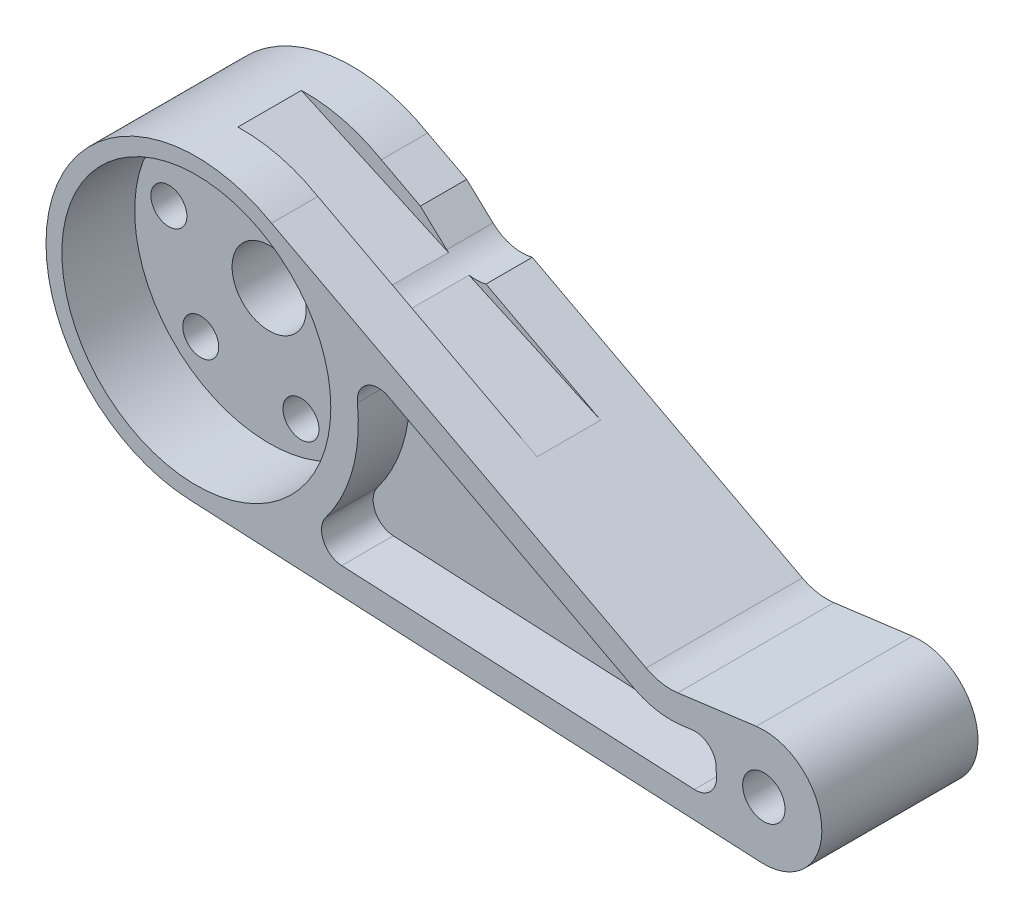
ISO-10303-21;
HEADER;
FILE_DESCRIPTION(('STEP AP214'),'2;1');
FILE_NAME('part.step','',(''),(''),'','','');
FILE_SCHEMA(('AUTOMOTIVE_DESIGN { 1 0 10303 214 1 1 1 1 }'));
ENDSEC;
DATA;
#1=APPLICATION_CONTEXT('core data for automotive mechanical design processes');
#2=APPLICATION_PROTOCOL_DEFINITION('international standard','automotive_design',2000,#1);
#3=PRODUCT_CONTEXT('',#1,'mechanical');
#4=PRODUCT('Part','Part','',(#3));
#5=PRODUCT_RELATED_PRODUCT_CATEGORY('part','',(#4));
#6=PRODUCT_DEFINITION_FORMATION('','',#4);
#7=PRODUCT_DEFINITION_CONTEXT('part definition',#1,'design');
#8=PRODUCT_DEFINITION('design','',#6,#7);
#9=PRODUCT_DEFINITION_SHAPE('','',#8);
#10=(LENGTH_UNIT() NAMED_UNIT(*) SI_UNIT(.MILLI.,.METRE.));
#11=(NAMED_UNIT(*) PLANE_ANGLE_UNIT() SI_UNIT($,.RADIAN.));
#12=(NAMED_UNIT(*) SI_UNIT($,.STERADIAN.) SOLID_ANGLE_UNIT());
#13=UNCERTAINTY_MEASURE_WITH_UNIT(LENGTH_MEASURE(1.E-05),#10,'distance_accuracy_value','');
#14=(GEOMETRIC_REPRESENTATION_CONTEXT(3) GLOBAL_UNCERTAINTY_ASSIGNED_CONTEXT((#13)) GLOBAL_UNIT_ASSIGNED_CONTEXT((#10,
#11,#12)) REPRESENTATION_CONTEXT('',''));
#15=CARTESIAN_POINT('',(0.,0.,0.));
#16=DIRECTION('',(0.,0.,1.));
#17=DIRECTION('',(1.,0.,0.));
#18=AXIS2_PLACEMENT_3D('',#15,#16,#17);
#19=CARTESIAN_POINT('',(8.39932325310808,23.953643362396,15.));
#20=DIRECTION('',(0.467137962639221,0.88418443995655,0.));
#21=DIRECTION('',(-0.88418443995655,0.467137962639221,0.));
#22=AXIS2_PLACEMENT_3D('',#19,#20,#21);
#23=PLANE('',#22);
#24=DIRECTION('',(0.,0.,-1.));
#25=VECTOR('',#24,1.);
#26=CARTESIAN_POINT('',(43.7810319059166,5.26055338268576,15.));
#27=LINE('',#26,#25);
#28=CARTESIAN_POINT('',(43.7810319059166,5.26055338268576,14.875));
#29=VERTEX_POINT('',#28);
#30=CARTESIAN_POINT('',(43.7810319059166,5.26055338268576,0.125));
#31=VERTEX_POINT('',#30);
#32=EDGE_CURVE('E553',#29,#31,#27,.T.);
#33=ORIENTED_EDGE('',*,*,#32,.T.);
#34=DIRECTION('',(-0.88418443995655,0.467137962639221,0.));
#35=VECTOR('',#34,1.);
#36=CARTESIAN_POINT('',(8.39932325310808,23.953643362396,0.125));
#37=LINE('',#36,#35);
#38=CARTESIAN_POINT('',(18.28346437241,18.7315908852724,0.125));
#39=VERTEX_POINT('',#38);
#40=EDGE_CURVE('E372',#31,#39,#37,.T.);
#41=ORIENTED_EDGE('',*,*,#40,.T.);
#42=DIRECTION('',(0.,0.,1.));
#43=VECTOR('',#42,1.);
#44=CARTESIAN_POINT('',(18.28346437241,18.7315908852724,0.));
#45=LINE('',#44,#43);
#46=CARTESIAN_POINT('',(18.28346437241,18.7315908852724,4.5));
#47=VERTEX_POINT('',#46);
#48=EDGE_CURVE('E491',#39,#47,#45,.T.);
#49=ORIENTED_EDGE('',*,*,#48,.T.);
#50=DIRECTION('',(0.88418443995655,-0.467137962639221,0.));
#51=VECTOR('',#50,1.);
#52=CARTESIAN_POINT('',(8.39932325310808,23.953643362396,4.5));
#53=LINE('',#52,#51);
#54=CARTESIAN_POINT('',(29.1103912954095,13.0114397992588,4.5));
#55=VERTEX_POINT('',#54);
#56=EDGE_CURVE('E503',#47,#55,#53,.T.);
#57=ORIENTED_EDGE('',*,*,#56,.T.);
#58=DIRECTION('',(0.,0.,1.));
#59=VECTOR('',#58,1.);
#60=CARTESIAN_POINT('',(29.11039129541,13.0114397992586,15.));
#61=LINE('',#60,#59);
#62=CARTESIAN_POINT('',(29.1103912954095,13.0114397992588,10.5));
#63=VERTEX_POINT('',#62);
#64=EDGE_CURVE('E507',#55,#63,#61,.T.);
#65=ORIENTED_EDGE('',*,*,#64,.T.);
#66=DIRECTION('',(0.88418443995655,-0.467137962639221,0.));
#67=VECTOR('',#66,1.);
#68=CARTESIAN_POINT('',(8.39932325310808,23.953643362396,10.5));
#69=LINE('',#68,#67);
#70=CARTESIAN_POINT('',(8.39932325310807,23.953643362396,10.5));
#71=VERTEX_POINT('',#70);
#72=EDGE_CURVE('E501',#71,#63,#69,.T.);
#73=ORIENTED_EDGE('',*,*,#72,.F.);
#74=DIRECTION('',(0.,0.,-1.));
#75=VECTOR('',#74,1.);
#76=CARTESIAN_POINT('',(8.39932325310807,23.953643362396,15.));
#77=LINE('',#76,#75);
#78=CARTESIAN_POINT('',(8.39932325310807,23.953643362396,14.875));
#79=VERTEX_POINT('',#78);
#80=EDGE_CURVE('E557',#79,#71,#77,.T.);
#81=ORIENTED_EDGE('',*,*,#80,.F.);
#82=DIRECTION('',(0.88418443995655,-0.467137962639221,0.));
#83=VECTOR('',#82,1.);
#84=CARTESIAN_POINT('',(8.39932325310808,23.953643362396,14.875));
#85=LINE('',#84,#83);
#86=EDGE_CURVE('E431',#79,#29,#85,.T.);
#87=ORIENTED_EDGE('',*,*,#86,.T.);
#88=EDGE_LOOP('',(#33,#41,#49,#57,#65,#73,#81,#87));
#89=FACE_BOUND('',#88,.T.);
#90=ADVANCED_FACE('F36',(#89),#23,.T.);
#91=CARTESIAN_POINT('',(1.29843356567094,11.6565963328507,15.));
#92=DIRECTION('',(0.,0.,-1.));
#93=DIRECTION('',(-1.,0.,0.));
#94=AXIS2_PLACEMENT_3D('',#91,#92,#93);
#95=CYLINDRICAL_SURFACE('',#94,14.2);
#96=CARTESIAN_POINT('',(8.39932325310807,23.953643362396,4.5));
#97=VERTEX_POINT('',#96);
#98=CARTESIAN_POINT('',(8.39932325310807,23.953643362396,0.125));
#99=VERTEX_POINT('',#98);
#100=EDGE_CURVE('E559',#97,#99,#77,.T.);
#101=ORIENTED_EDGE('',*,*,#100,.T.);
#102=CARTESIAN_POINT('',(1.29843356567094,11.6565963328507,0.125));
#103=DIRECTION('',(0.,0.,-1.));
#104=DIRECTION('',(-1.,0.,0.));
#105=AXIS2_PLACEMENT_3D('',#102,#103,#104);
#106=CIRCLE('',#105,14.2);
#107=CARTESIAN_POINT('',(0.59338016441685,-2.5258893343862,0.125));
#108=VERTEX_POINT('',#107);
#109=EDGE_CURVE('E369',#99,#108,#106,.F.);
#110=ORIENTED_EDGE('',*,*,#109,.T.);
#111=DIRECTION('',(0.,0.,-1.));
#112=VECTOR('',#111,1.);
#113=CARTESIAN_POINT('',(0.59338016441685,-2.52588933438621,15.));
#114=LINE('',#113,#112);
#115=CARTESIAN_POINT('',(0.593380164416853,-2.52588933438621,14.875));
#116=VERTEX_POINT('',#115);
#117=EDGE_CURVE('E560',#116,#108,#114,.T.);
#118=ORIENTED_EDGE('',*,*,#117,.F.);
#119=CARTESIAN_POINT('',(1.29843356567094,11.6565963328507,14.875));
#120=DIRECTION('',(0.,0.,1.));
#121=DIRECTION('',(1.,0.,0.));
#122=AXIS2_PLACEMENT_3D('',#119,#120,#121);
#123=CIRCLE('',#122,14.2);
#124=EDGE_CURVE('E428',#116,#79,#123,.F.);
#125=ORIENTED_EDGE('',*,*,#124,.T.);
#126=ORIENTED_EDGE('',*,*,#80,.T.);
#127=CARTESIAN_POINT('',(1.29843356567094,11.6565963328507,10.5));
#128=DIRECTION('',(0.,0.,1.));
#129=DIRECTION('',(1.,0.,0.));
#130=AXIS2_PLACEMENT_3D('',#127,#128,#129);
#131=CIRCLE('',#130,14.2);
#132=CARTESIAN_POINT('',(0.841496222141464,25.849242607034,10.5));
#133=VERTEX_POINT('',#132);
#134=EDGE_CURVE('E556',#133,#71,#131,.F.);
#135=ORIENTED_EDGE('',*,*,#134,.F.);
#136=DIRECTION('',(0.,0.,-1.));
#137=VECTOR('',#136,1.);
#138=CARTESIAN_POINT('',(0.841496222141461,25.849242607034,15.));
#139=LINE('',#138,#137);
#140=CARTESIAN_POINT('',(0.841496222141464,25.849242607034,4.5));
#141=VERTEX_POINT('',#140);
#142=EDGE_CURVE('E573',#133,#141,#139,.T.);
#143=ORIENTED_EDGE('',*,*,#142,.T.);
#144=CARTESIAN_POINT('',(1.29843356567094,11.6565963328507,4.5));
#145=DIRECTION('',(0.,0.,1.));
#146=DIRECTION('',(1.,0.,0.));
#147=AXIS2_PLACEMENT_3D('',#144,#145,#146);
#148=CIRCLE('',#147,14.2);
#149=EDGE_CURVE('E576',#141,#97,#148,.F.);
#150=ORIENTED_EDGE('',*,*,#149,.T.);
#151=EDGE_LOOP('',(#101,#110,#118,#125,#126,#135,#143,#150));
#152=FACE_BOUND('',#151,.T.);
#153=ADVANCED_FACE('F642',(#152),#95,.T.);
#154=CARTESIAN_POINT('',(46.1167217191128,9.68147558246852,15.));
#155=DIRECTION('',(0.,0.,-1.));
#156=DIRECTION('',(-1.,0.,0.));
#157=AXIS2_PLACEMENT_3D('',#154,#155,#156);
#158=CYLINDRICAL_SURFACE('',#157,5.);
#159=DIRECTION('',(0.,0.,-1.));
#160=VECTOR('',#159,1.);
#161=CARTESIAN_POINT('',(46.7655224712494,4.72374852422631,15.));
#162=LINE('',#161,#160);
#163=CARTESIAN_POINT('',(46.7655224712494,4.72374852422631,14.875));
#164=VERTEX_POINT('',#163);
#165=CARTESIAN_POINT('',(46.7655224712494,4.72374852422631,0.125));
#166=VERTEX_POINT('',#165);
#167=EDGE_CURVE('E552',#164,#166,#162,.T.);
#168=ORIENTED_EDGE('',*,*,#167,.T.);
#169=CARTESIAN_POINT('',(46.1167217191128,9.68147558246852,0.125));
#170=DIRECTION('',(0.,0.,-1.));
#171=DIRECTION('',(-1.,0.,0.));
#172=AXIS2_PLACEMENT_3D('',#169,#170,#171);
#173=CIRCLE('',#172,5.);
#174=EDGE_CURVE('E378',#166,#31,#173,.T.);
#175=ORIENTED_EDGE('',*,*,#174,.T.);
#176=ORIENTED_EDGE('',*,*,#32,.F.);
#177=CARTESIAN_POINT('',(46.1167217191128,9.68147558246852,14.875));
#178=DIRECTION('',(0.,0.,1.));
#179=DIRECTION('',(1.,0.,0.));
#180=AXIS2_PLACEMENT_3D('',#177,#178,#179);
#181=CIRCLE('',#180,5.);
#182=EDGE_CURVE('E425',#29,#164,#181,.T.);
#183=ORIENTED_EDGE('',*,*,#182,.T.);
#184=EDGE_LOOP('',(#168,#175,#176,#183));
#185=FACE_BOUND('',#184,.T.);
#186=ADVANCED_FACE('F650',(#185),#158,.F.);
#187=CARTESIAN_POINT('',(54.6284633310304,-5.21213348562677,15.));
#188=DIRECTION('',(-0.0496516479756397,-0.998766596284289,0.));
#189=DIRECTION('',(0.998766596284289,-0.0496516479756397,0.));
#190=AXIS2_PLACEMENT_3D('',#187,#188,#189);
#191=PLANE('',#190);
#192=ORIENTED_EDGE('',*,*,#117,.T.);
#193=DIRECTION('',(0.998766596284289,-0.0496516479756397,0.));
#194=VECTOR('',#193,1.);
#195=CARTESIAN_POINT('',(54.6284633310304,-5.21213348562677,0.125));
#196=LINE('',#195,#194);
#197=CARTESIAN_POINT('',(54.6284633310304,-5.21213348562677,0.125));
#198=VERTEX_POINT('',#197);
#199=EDGE_CURVE('E375',#108,#198,#196,.T.);
#200=ORIENTED_EDGE('',*,*,#199,.T.);
#201=DIRECTION('',(0.,0.,-1.));
#202=VECTOR('',#201,1.);
#203=CARTESIAN_POINT('',(54.6284633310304,-5.21213348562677,15.));
#204=LINE('',#203,#202);
#205=CARTESIAN_POINT('',(54.6284633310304,-5.21213348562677,14.875));
#206=VERTEX_POINT('',#205);
#207=EDGE_CURVE('E563',#206,#198,#204,.T.);
#208=ORIENTED_EDGE('',*,*,#207,.F.);
#209=DIRECTION('',(-0.998766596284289,0.0496516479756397,0.));
#210=VECTOR('',#209,1.);
#211=CARTESIAN_POINT('',(54.6284633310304,-5.21213348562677,14.875));
#212=LINE('',#211,#210);
#213=EDGE_CURVE('E422',#206,#116,#212,.T.);
#214=ORIENTED_EDGE('',*,*,#213,.T.);
#215=EDGE_LOOP('',(#192,#200,#208,#214));
#216=FACE_BOUND('',#215,.T.);
#217=ADVANCED_FACE('F706',(#216),#191,.T.);
#218=CARTESIAN_POINT('',(54.9005672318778,0.261366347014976,15.));
#219=DIRECTION('',(0.,0.,-1.));
#220=DIRECTION('',(-1.,0.,0.));
#221=AXIS2_PLACEMENT_3D('',#218,#219,#220);
#222=CYLINDRICAL_SURFACE('',#221,5.48025920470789);
#223=ORIENTED_EDGE('',*,*,#207,.T.);
#224=CARTESIAN_POINT('',(54.9005672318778,0.261366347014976,0.125));
#225=DIRECTION('',(0.,0.,-1.));
#226=DIRECTION('',(-1.,0.,0.));
#227=AXIS2_PLACEMENT_3D('',#224,#225,#226);
#228=CIRCLE('',#227,5.48025920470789);
#229=CARTESIAN_POINT('',(54.1894479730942,5.69529221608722,0.125));
#230=VERTEX_POINT('',#229);
#231=EDGE_CURVE('E384',#198,#230,#228,.F.);
#232=ORIENTED_EDGE('',*,*,#231,.T.);
#233=DIRECTION('',(0.,0.,-1.));
#234=VECTOR('',#233,1.);
#235=CARTESIAN_POINT('',(54.1894479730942,5.69529221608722,15.));
#236=LINE('',#235,#234);
#237=CARTESIAN_POINT('',(54.1894479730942,5.69529221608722,14.875));
#238=VERTEX_POINT('',#237);
#239=EDGE_CURVE('E566',#238,#230,#236,.T.);
#240=ORIENTED_EDGE('',*,*,#239,.F.);
#241=CARTESIAN_POINT('',(54.9005672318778,0.261366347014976,14.875));
#242=DIRECTION('',(0.,0.,1.));
#243=DIRECTION('',(1.,0.,0.));
#244=AXIS2_PLACEMENT_3D('',#241,#242,#243);
#245=CIRCLE('',#244,5.48025920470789);
#246=EDGE_CURVE('E419',#238,#206,#245,.F.);
#247=ORIENTED_EDGE('',*,*,#246,.T.);
#248=EDGE_LOOP('',(#223,#232,#240,#247));
#249=FACE_BOUND('',#248,.T.);
#250=ADVANCED_FACE('F703',(#249),#222,.T.);
#251=CARTESIAN_POINT('',(46.7655224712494,4.72374852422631,15.));
#252=DIRECTION('',(-0.129760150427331,0.991545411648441,0.));
#253=DIRECTION('',(-0.991545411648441,-0.129760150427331,0.));
#254=AXIS2_PLACEMENT_3D('',#251,#252,#253);
#255=PLANE('',#254);
#256=ORIENTED_EDGE('',*,*,#239,.T.);
#257=DIRECTION('',(-0.991545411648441,-0.129760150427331,0.));
#258=VECTOR('',#257,1.);
#259=CARTESIAN_POINT('',(46.7655224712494,4.72374852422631,0.125));
#260=LINE('',#259,#258);
#261=EDGE_CURVE('E381',#230,#166,#260,.T.);
#262=ORIENTED_EDGE('',*,*,#261,.T.);
#263=ORIENTED_EDGE('',*,*,#167,.F.);
#264=DIRECTION('',(0.991545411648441,0.129760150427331,0.));
#265=VECTOR('',#264,1.);
#266=CARTESIAN_POINT('',(46.7655224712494,4.72374852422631,14.875));
#267=LINE('',#266,#265);
#268=EDGE_CURVE('E416',#164,#238,#267,.T.);
#269=ORIENTED_EDGE('',*,*,#268,.T.);
#270=EDGE_LOOP('',(#256,#262,#263,#269));
#271=FACE_BOUND('',#270,.T.);
#272=ADVANCED_FACE('F665',(#271),#255,.T.);
#273=CARTESIAN_POINT('',(54.9005672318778,0.261366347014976,0.));
#274=DIRECTION('',(0.,0.,-1.));
#275=DIRECTION('',(-1.,0.,0.));
#276=AXIS2_PLACEMENT_3D('',#273,#274,#275);
#277=CYLINDRICAL_SURFACE('',#276,1.99999999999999);
#278=CARTESIAN_POINT('',(54.9005672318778,0.261366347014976,14.875));
#279=DIRECTION('',(0.,0.,1.));
#280=DIRECTION('',(1.,0.,0.));
#281=AXIS2_PLACEMENT_3D('',#278,#279,#280);
#282=CIRCLE('',#281,1.99999999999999);
#283=CARTESIAN_POINT('',(56.9005672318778,0.261366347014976,14.875));
#284=VERTEX_POINT('',#283);
#285=EDGE_CURVE('E413',#284,#284,#282,.F.);
#286=ORIENTED_EDGE('',*,*,#285,.F.);
#287=EDGE_LOOP('',(#286));
#288=FACE_BOUND('',#287,.T.);
#289=CARTESIAN_POINT('',(54.9005672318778,0.261366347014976,0.125));
#290=DIRECTION('',(0.,0.,-1.));
#291=DIRECTION('',(-1.,0.,0.));
#292=AXIS2_PLACEMENT_3D('',#289,#290,#291);
#293=CIRCLE('',#292,1.99999999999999);
#294=CARTESIAN_POINT('',(52.9005672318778,0.261366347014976,0.125));
#295=VERTEX_POINT('',#294);
#296=EDGE_CURVE('E390',#295,#295,#293,.F.);
#297=ORIENTED_EDGE('',*,*,#296,.F.);
#298=EDGE_LOOP('',(#297));
#299=FACE_BOUND('',#298,.T.);
#300=ADVANCED_FACE('F656',(#288,#299),#277,.F.);
#301=DIRECTION('',(0.,0.,-1.));
#302=VECTOR('',#301,1.);
#303=CARTESIAN_POINT('',(12.0831855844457,22.0073617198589,15.));
#304=LINE('',#303,#302);
#305=CARTESIAN_POINT('',(12.0831855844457,22.0073617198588,4.5));
#306=VERTEX_POINT('',#305);
#307=CARTESIAN_POINT('',(12.0831855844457,22.0073617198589,0.125));
#308=VERTEX_POINT('',#307);
#309=EDGE_CURVE('E478',#306,#308,#304,.T.);
#310=ORIENTED_EDGE('',*,*,#309,.T.);
#311=DIRECTION('',(-0.88418443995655,0.467137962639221,0.));
#312=VECTOR('',#311,1.);
#313=CARTESIAN_POINT('',(8.39932325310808,23.953643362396,0.125));
#314=LINE('',#313,#312);
#315=EDGE_CURVE('E51',#308,#99,#314,.T.);
#316=ORIENTED_EDGE('',*,*,#315,.T.);
#317=ORIENTED_EDGE('',*,*,#100,.F.);
#318=EDGE_CURVE('E504',#97,#306,#53,.T.);
#319=ORIENTED_EDGE('',*,*,#318,.T.);
#320=EDGE_LOOP('',(#310,#316,#317,#319));
#321=FACE_BOUND('',#320,.T.);
#322=ADVANCED_FACE('F645',(#321),#23,.T.);
#323=CARTESIAN_POINT('',(1.29843356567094,11.6565963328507,0.));
#324=DIRECTION('',(0.,0.,-1.));
#325=DIRECTION('',(-1.,0.,0.));
#326=AXIS2_PLACEMENT_3D('',#323,#324,#325);
#327=CYLINDRICAL_SURFACE('',#326,12.8);
#328=CARTESIAN_POINT('',(1.29843356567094,11.6565963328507,3.));
#329=DIRECTION('',(0.,0.,-1.));
#330=DIRECTION('',(-1.,0.,0.));
#331=AXIS2_PLACEMENT_3D('',#328,#329,#330);
#332=CIRCLE('',#331,12.8);
#333=CARTESIAN_POINT('',(-11.5015664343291,11.6565963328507,3.));
#334=VERTEX_POINT('',#333);
#335=EDGE_CURVE('E546',#334,#334,#332,.T.);
#336=ORIENTED_EDGE('',*,*,#335,.F.);
#337=EDGE_LOOP('',(#336));
#338=FACE_BOUND('',#337,.T.);
#339=CARTESIAN_POINT('',(1.29843356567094,11.6565963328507,0.125));
#340=DIRECTION('',(0.,0.,-1.));
#341=DIRECTION('',(-1.,0.,0.));
#342=AXIS2_PLACEMENT_3D('',#339,#340,#341);
#343=CIRCLE('',#342,12.8);
#344=CARTESIAN_POINT('',(-11.5015664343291,11.6565963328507,0.125));
#345=VERTEX_POINT('',#344);
#346=EDGE_CURVE('E387',#345,#345,#343,.F.);
#347=ORIENTED_EDGE('',*,*,#346,.F.);
#348=EDGE_LOOP('',(#347));
#349=FACE_BOUND('',#348,.T.);
#350=ADVANCED_FACE('F655',(#338,#349),#327,.F.);
#351=CARTESIAN_POINT('',(17.2992298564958,22.60861067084,0.));
#352=DIRECTION('',(0.,0.,1.));
#353=DIRECTION('',(1.,0.,0.));
#354=AXIS2_PLACEMENT_3D('',#351,#352,#353);
#355=CYLINDRICAL_SURFACE('',#354,4.);
#356=ORIENTED_EDGE('',*,*,#48,.F.);
#357=CARTESIAN_POINT('',(17.2992298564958,22.60861067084,0.125));
#358=DIRECTION('',(0.,0.,-1.));
#359=DIRECTION('',(-1.,0.,0.));
#360=AXIS2_PLACEMENT_3D('',#357,#358,#359);
#361=CIRCLE('',#360,4.);
#362=CARTESIAN_POINT('',(14.5687094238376,19.6855543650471,0.125));
#363=VERTEX_POINT('',#362);
#364=EDGE_CURVE('E365',#39,#363,#361,.T.);
#365=ORIENTED_EDGE('',*,*,#364,.T.);
#366=DIRECTION('',(0.,0.,1.));
#367=VECTOR('',#366,1.);
#368=CARTESIAN_POINT('',(14.5687094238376,19.6855543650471,0.));
#369=LINE('',#368,#367);
#370=CARTESIAN_POINT('',(14.5687094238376,19.6855543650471,4.5));
#371=VERTEX_POINT('',#370);
#372=EDGE_CURVE('E473',#363,#371,#369,.T.);
#373=ORIENTED_EDGE('',*,*,#372,.T.);
#374=CARTESIAN_POINT('',(17.2992298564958,22.60861067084,4.5));
#375=DIRECTION('',(0.,0.,1.));
#376=DIRECTION('',(1.,0.,0.));
#377=AXIS2_PLACEMENT_3D('',#374,#375,#376);
#378=CIRCLE('',#377,4.);
#379=CARTESIAN_POINT('',(14.7320616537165,19.5410958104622,4.5));
#380=VERTEX_POINT('',#379);
#381=EDGE_CURVE('E481',#380,#371,#378,.F.);
#382=ORIENTED_EDGE('',*,*,#381,.F.);
#383=DIRECTION('',(0.,0.,1.));
#384=VECTOR('',#383,1.);
#385=CARTESIAN_POINT('',(14.7320616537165,19.5410958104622,0.));
#386=LINE('',#385,#384);
#387=CARTESIAN_POINT('',(14.7320616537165,19.5410958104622,10.5));
#388=VERTEX_POINT('',#387);
#389=EDGE_CURVE('E484',#388,#380,#386,.F.);
#390=ORIENTED_EDGE('',*,*,#389,.F.);
#391=CARTESIAN_POINT('',(17.2992298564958,22.60861067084,10.5));
#392=DIRECTION('',(0.,0.,-1.));
#393=DIRECTION('',(-1.,0.,0.));
#394=AXIS2_PLACEMENT_3D('',#391,#392,#393);
#395=CIRCLE('',#394,4.);
#396=CARTESIAN_POINT('',(16.6787995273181,18.6570203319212,10.5));
#397=VERTEX_POINT('',#396);
#398=EDGE_CURVE('E470',#397,#388,#395,.T.);
#399=ORIENTED_EDGE('',*,*,#398,.F.);
#400=DIRECTION('',(0.,0.,1.));
#401=VECTOR('',#400,1.);
#402=CARTESIAN_POINT('',(16.6787995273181,18.6570203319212,0.));
#403=LINE('',#402,#401);
#404=CARTESIAN_POINT('',(16.6787995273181,18.6570203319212,4.5));
#405=VERTEX_POINT('',#404);
#406=EDGE_CURVE('E488',#405,#397,#403,.T.);
#407=ORIENTED_EDGE('',*,*,#406,.F.);
#408=EDGE_CURVE('E485',#47,#405,#378,.F.);
#409=ORIENTED_EDGE('',*,*,#408,.F.);
#410=EDGE_LOOP('',(#356,#365,#373,#382,#390,#399,#407,#409));
#411=FACE_BOUND('',#410,.T.);
#412=ADVANCED_FACE('F662',(#411),#355,.F.);
#413=CARTESIAN_POINT('',(8.87774188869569,25.0016692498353,0.));
#414=DIRECTION('',(0.682630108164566,0.730764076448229,0.));
#415=DIRECTION('',(-0.730764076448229,0.682630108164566,0.));
#416=AXIS2_PLACEMENT_3D('',#413,#414,#415);
#417=PLANE('',#416);
#418=ORIENTED_EDGE('',*,*,#372,.F.);
#419=DIRECTION('',(-0.730764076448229,0.682630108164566,0.));
#420=VECTOR('',#419,1.);
#421=CARTESIAN_POINT('',(8.87774188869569,25.0016692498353,0.125));
#422=LINE('',#421,#420);
#423=EDGE_CURVE('E358',#363,#308,#422,.T.);
#424=ORIENTED_EDGE('',*,*,#423,.T.);
#425=ORIENTED_EDGE('',*,*,#309,.F.);
#426=DIRECTION('',(-0.730764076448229,0.682630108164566,0.));
#427=VECTOR('',#426,1.);
#428=CARTESIAN_POINT('',(0.798342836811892,32.5488944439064,4.5));
#429=LINE('',#428,#427);
#430=EDGE_CURVE('E475',#371,#306,#429,.T.);
#431=ORIENTED_EDGE('',*,*,#430,.F.);
#432=EDGE_LOOP('',(#418,#424,#425,#431));
#433=FACE_BOUND('',#432,.T.);
#434=ADVANCED_FACE('F672',(#433),#417,.T.);
#435=CARTESIAN_POINT('',(1.29843356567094,11.6565963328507,8.00000000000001));
#436=DIRECTION('',(0.,0.,1.));
#437=DIRECTION('',(1.,0.,0.));
#438=AXIS2_PLACEMENT_3D('',#435,#436,#437);
#439=CYLINDRICAL_SURFACE('',#438,12.7);
#440=CARTESIAN_POINT('',(1.29843356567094,11.6565963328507,8.00000000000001));
#441=DIRECTION('',(0.,0.,1.));
#442=DIRECTION('',(1.,0.,0.));
#443=AXIS2_PLACEMENT_3D('',#440,#441,#442);
#444=CIRCLE('',#443,12.7);
#445=CARTESIAN_POINT('',(13.9984335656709,11.6565963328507,8.00000000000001));
#446=VERTEX_POINT('',#445);
#447=EDGE_CURVE('E466',#446,#446,#444,.T.);
#448=ORIENTED_EDGE('',*,*,#447,.F.);
#449=EDGE_LOOP('',(#448));
#450=FACE_BOUND('',#449,.T.);
#451=CARTESIAN_POINT('',(1.29843356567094,11.6565963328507,14.875));
#452=DIRECTION('',(0.,0.,1.));
#453=DIRECTION('',(1.,0.,0.));
#454=AXIS2_PLACEMENT_3D('',#451,#452,#453);
#455=CIRCLE('',#454,12.7);
#456=CARTESIAN_POINT('',(13.9984335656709,11.6565963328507,14.875));
#457=VERTEX_POINT('',#456);
#458=EDGE_CURVE('E410',#457,#457,#455,.F.);
#459=ORIENTED_EDGE('',*,*,#458,.F.);
#460=EDGE_LOOP('',(#459));
#461=FACE_BOUND('',#460,.T.);
#462=ADVANCED_FACE('F716',(#450,#461),#439,.F.);
#463=CARTESIAN_POINT('',(1.29843356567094,11.6565963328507,0.));
#464=DIRECTION('',(0.,0.,-1.));
#465=DIRECTION('',(-1.,0.,0.));
#466=AXIS2_PLACEMENT_3D('',#463,#464,#465);
#467=CYLINDRICAL_SURFACE('',#466,3.5);
#468=CARTESIAN_POINT('',(1.29843356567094,11.6565963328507,3.));
#469=DIRECTION('',(0.,0.,-1.));
#470=DIRECTION('',(-1.,0.,0.));
#471=AXIS2_PLACEMENT_3D('',#468,#469,#470);
#472=CIRCLE('',#471,3.5);
#473=CARTESIAN_POINT('',(-2.20156643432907,11.6565963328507,3.));
#474=VERTEX_POINT('',#473);
#475=EDGE_CURVE('E549',#474,#474,#472,.T.);
#476=ORIENTED_EDGE('',*,*,#475,.T.);
#477=EDGE_LOOP('',(#476));
#478=FACE_BOUND('',#477,.T.);
#479=CARTESIAN_POINT('',(1.29843356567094,11.6565963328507,8.00000000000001));
#480=DIRECTION('',(0.,0.,1.));
#481=DIRECTION('',(1.,0.,0.));
#482=AXIS2_PLACEMENT_3D('',#479,#480,#481);
#483=CIRCLE('',#482,3.5);
#484=CARTESIAN_POINT('',(4.79843356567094,11.6565963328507,8.00000000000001));
#485=VERTEX_POINT('',#484);
#486=EDGE_CURVE('E469',#485,#485,#483,.F.);
#487=ORIENTED_EDGE('',*,*,#486,.F.);
#488=EDGE_LOOP('',(#487));
#489=FACE_BOUND('',#488,.T.);
#490=ADVANCED_FACE('F718',(#478,#489),#467,.F.);
#491=CARTESIAN_POINT('',(-2.35557927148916,27.3011360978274,4.5));
#492=DIRECTION('',(0.413490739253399,0.910508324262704,0.));
#493=DIRECTION('',(-0.910508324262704,0.413490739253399,0.));
#494=AXIS2_PLACEMENT_3D('',#491,#492,#493);
#495=PLANE('',#494);
#496=DIRECTION('',(-0.910508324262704,0.413490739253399,0.));
#497=VECTOR('',#496,1.);
#498=CARTESIAN_POINT('',(-2.35557927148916,27.3011360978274,10.5));
#499=LINE('',#498,#497);
#500=EDGE_CURVE('E493',#388,#133,#499,.T.);
#501=ORIENTED_EDGE('',*,*,#500,.F.);
#502=ORIENTED_EDGE('',*,*,#389,.T.);
#503=DIRECTION('',(-0.910508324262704,0.413490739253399,0.));
#504=VECTOR('',#503,1.);
#505=CARTESIAN_POINT('',(-2.35557927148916,27.3011360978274,4.5));
#506=LINE('',#505,#504);
#507=EDGE_CURVE('E497',#380,#141,#506,.T.);
#508=ORIENTED_EDGE('',*,*,#507,.T.);
#509=ORIENTED_EDGE('',*,*,#142,.F.);
#510=EDGE_LOOP('',(#501,#502,#508,#509));
#511=FACE_BOUND('',#510,.T.);
#512=ADVANCED_FACE('F681',(#511),#495,.T.);
#513=EDGE_CURVE('E498',#55,#405,#506,.T.);
#514=ORIENTED_EDGE('',*,*,#513,.T.);
#515=ORIENTED_EDGE('',*,*,#406,.T.);
#516=EDGE_CURVE('E494',#63,#397,#499,.T.);
#517=ORIENTED_EDGE('',*,*,#516,.F.);
#518=ORIENTED_EDGE('',*,*,#64,.F.);
#519=EDGE_LOOP('',(#514,#515,#517,#518));
#520=FACE_BOUND('',#519,.T.);
#521=ADVANCED_FACE('F691',(#520),#495,.T.);
#522=CARTESIAN_POINT('',(-0.701616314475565,30.9431693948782,4.5));
#523=DIRECTION('',(0.,0.,1.));
#524=DIRECTION('',(1.,0.,0.));
#525=AXIS2_PLACEMENT_3D('',#522,#523,#524);
#526=PLANE('',#525);
#527=ORIENTED_EDGE('',*,*,#56,.F.);
#528=ORIENTED_EDGE('',*,*,#408,.T.);
#529=ORIENTED_EDGE('',*,*,#513,.F.);
#530=EDGE_LOOP('',(#527,#528,#529));
#531=FACE_BOUND('',#530,.T.);
#532=ADVANCED_FACE('F696',(#531),#526,.T.);
#533=ORIENTED_EDGE('',*,*,#507,.F.);
#534=ORIENTED_EDGE('',*,*,#381,.T.);
#535=ORIENTED_EDGE('',*,*,#430,.T.);
#536=ORIENTED_EDGE('',*,*,#318,.F.);
#537=ORIENTED_EDGE('',*,*,#149,.F.);
#538=EDGE_LOOP('',(#533,#534,#535,#536,#537));
#539=FACE_BOUND('',#538,.T.);
#540=ADVANCED_FACE('F675',(#539),#526,.T.);
#541=CARTESIAN_POINT('',(4.79843356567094,11.6565963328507,3.));
#542=DIRECTION('',(0.,0.,1.));
#543=DIRECTION('',(1.,0.,0.));
#544=AXIS2_PLACEMENT_3D('',#541,#542,#543);
#545=PLANE('',#544);
#546=CARTESIAN_POINT('',(-1.71115667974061,20.851594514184,3.));
#547=DIRECTION('',(0.,0.,1.));
#548=DIRECTION('',(1.,0.,0.));
#549=AXIS2_PLACEMENT_3D('',#546,#547,#548);
#550=CIRCLE('',#549,1.7);
#551=CARTESIAN_POINT('',(-0.0111566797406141,20.851594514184,3.));
#552=VERTEX_POINT('',#551);
#553=EDGE_CURVE('E437',#552,#552,#550,.T.);
#554=ORIENTED_EDGE('',*,*,#553,.T.);
#555=EDGE_LOOP('',(#554));
#556=FACE_BOUND('',#555,.T.);
#557=CARTESIAN_POINT('',(-8.16946356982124,13.6477138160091,3.));
#558=DIRECTION('',(0.,0.,1.));
#559=DIRECTION('',(1.,0.,0.));
#560=AXIS2_PLACEMENT_3D('',#557,#558,#559);
#561=CIRCLE('',#560,1.7);
#562=CARTESIAN_POINT('',(-6.46946356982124,13.6477138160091,3.));
#563=VERTEX_POINT('',#562);
#564=EDGE_CURVE('E443',#563,#563,#561,.T.);
#565=ORIENTED_EDGE('',*,*,#564,.T.);
#566=EDGE_LOOP('',(#565));
#567=FACE_BOUND('',#566,.T.);
#568=CARTESIAN_POINT('',(-5.1598733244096,4.4527156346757,3.));
#569=DIRECTION('',(0.,0.,1.));
#570=DIRECTION('',(1.,0.,0.));
#571=AXIS2_PLACEMENT_3D('',#568,#569,#570);
#572=CIRCLE('',#571,1.7);
#573=CARTESIAN_POINT('',(-3.45987332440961,4.4527156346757,3.));
#574=VERTEX_POINT('',#573);
#575=EDGE_CURVE('E449',#574,#574,#572,.T.);
#576=ORIENTED_EDGE('',*,*,#575,.T.);
#577=EDGE_LOOP('',(#576));
#578=FACE_BOUND('',#577,.T.);
#579=CARTESIAN_POINT('',(4.30802381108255,2.46159815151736,3.));
#580=DIRECTION('',(0.,0.,1.));
#581=DIRECTION('',(1.,0.,0.));
#582=AXIS2_PLACEMENT_3D('',#579,#580,#581);
#583=CIRCLE('',#582,1.7);
#584=CARTESIAN_POINT('',(6.00802381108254,2.46159815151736,3.));
#585=VERTEX_POINT('',#584);
#586=EDGE_CURVE('E453',#585,#585,#583,.T.);
#587=ORIENTED_EDGE('',*,*,#586,.T.);
#588=EDGE_LOOP('',(#587));
#589=FACE_BOUND('',#588,.T.);
#590=CARTESIAN_POINT('',(10.7663307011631,9.66547884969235,3.));
#591=DIRECTION('',(0.,0.,1.));
#592=DIRECTION('',(1.,0.,0.));
#593=AXIS2_PLACEMENT_3D('',#590,#591,#592);
#594=CIRCLE('',#593,1.7);
#595=CARTESIAN_POINT('',(12.4663307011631,9.66547884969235,3.));
#596=VERTEX_POINT('',#595);
#597=EDGE_CURVE('E457',#596,#596,#594,.T.);
#598=ORIENTED_EDGE('',*,*,#597,.T.);
#599=EDGE_LOOP('',(#598));
#600=FACE_BOUND('',#599,.T.);
#601=CARTESIAN_POINT('',(7.75674045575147,18.8604770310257,3.));
#602=DIRECTION('',(0.,0.,1.));
#603=DIRECTION('',(1.,0.,0.));
#604=AXIS2_PLACEMENT_3D('',#601,#602,#603);
#605=CIRCLE('',#604,1.7);
#606=CARTESIAN_POINT('',(9.45674045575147,18.8604770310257,3.));
#607=VERTEX_POINT('',#606);
#608=EDGE_CURVE('E463',#607,#607,#605,.T.);
#609=ORIENTED_EDGE('',*,*,#608,.T.);
#610=EDGE_LOOP('',(#609));
#611=FACE_BOUND('',#610,.T.);
#612=ORIENTED_EDGE('',*,*,#475,.F.);
#613=EDGE_LOOP('',(#612));
#614=FACE_BOUND('',#613,.T.);
#615=ORIENTED_EDGE('',*,*,#335,.T.);
#616=EDGE_LOOP('',(#615));
#617=FACE_BOUND('',#616,.T.);
#618=ADVANCED_FACE('F739',(#556,#567,#578,#589,#600,#611,#614,#617),#545,.F.);
#619=CARTESIAN_POINT('',(-0.701616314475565,30.9431693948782,10.5));
#620=DIRECTION('',(0.,0.,1.));
#621=DIRECTION('',(1.,0.,0.));
#622=AXIS2_PLACEMENT_3D('',#619,#620,#621);
#623=PLANE('',#622);
#624=ORIENTED_EDGE('',*,*,#72,.T.);
#625=ORIENTED_EDGE('',*,*,#516,.T.);
#626=ORIENTED_EDGE('',*,*,#398,.T.);
#627=ORIENTED_EDGE('',*,*,#500,.T.);
#628=ORIENTED_EDGE('',*,*,#134,.T.);
#629=EDGE_LOOP('',(#624,#625,#626,#627,#628));
#630=FACE_BOUND('',#629,.T.);
#631=ADVANCED_FACE('F685',(#630),#623,.F.);
#632=CARTESIAN_POINT('',(1.29843356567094,11.6565963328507,8.00000000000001));
#633=DIRECTION('',(0.,0.,1.));
#634=DIRECTION('',(1.,0.,0.));
#635=AXIS2_PLACEMENT_3D('',#632,#633,#634);
#636=PLANE('',#635);
#637=CARTESIAN_POINT('',(-1.71115667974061,20.851594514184,8.00000000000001));
#638=DIRECTION('',(0.,0.,1.));
#639=DIRECTION('',(1.,0.,0.));
#640=AXIS2_PLACEMENT_3D('',#637,#638,#639);
#641=CIRCLE('',#640,1.7);
#642=CARTESIAN_POINT('',(-0.0111566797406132,20.851594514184,8.00000000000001));
#643=VERTEX_POINT('',#642);
#644=EDGE_CURVE('E434',#643,#643,#641,.T.);
#645=ORIENTED_EDGE('',*,*,#644,.F.);
#646=EDGE_LOOP('',(#645));
#647=FACE_BOUND('',#646,.T.);
#648=CARTESIAN_POINT('',(-8.16946356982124,13.6477138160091,8.00000000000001));
#649=DIRECTION('',(0.,0.,1.));
#650=DIRECTION('',(1.,0.,0.));
#651=AXIS2_PLACEMENT_3D('',#648,#649,#650);
#652=CIRCLE('',#651,1.7);
#653=CARTESIAN_POINT('',(-6.46946356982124,13.6477138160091,8.00000000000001));
#654=VERTEX_POINT('',#653);
#655=EDGE_CURVE('E440',#654,#654,#652,.T.);
#656=ORIENTED_EDGE('',*,*,#655,.F.);
#657=EDGE_LOOP('',(#656));
#658=FACE_BOUND('',#657,.T.);
#659=CARTESIAN_POINT('',(-5.1598733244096,4.4527156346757,8.00000000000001));
#660=DIRECTION('',(0.,0.,1.));
#661=DIRECTION('',(1.,0.,0.));
#662=AXIS2_PLACEMENT_3D('',#659,#660,#661);
#663=CIRCLE('',#662,1.7);
#664=CARTESIAN_POINT('',(-3.45987332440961,4.4527156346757,8.00000000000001));
#665=VERTEX_POINT('',#664);
#666=EDGE_CURVE('E446',#665,#665,#663,.T.);
#667=ORIENTED_EDGE('',*,*,#666,.F.);
#668=EDGE_LOOP('',(#667));
#669=FACE_BOUND('',#668,.T.);
#670=CARTESIAN_POINT('',(4.30802381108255,2.46159815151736,8.00000000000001));
#671=DIRECTION('',(0.,0.,1.));
#672=DIRECTION('',(1.,0.,0.));
#673=AXIS2_PLACEMENT_3D('',#670,#671,#672);
#674=CIRCLE('',#673,1.7);
#675=CARTESIAN_POINT('',(6.00802381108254,2.46159815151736,8.00000000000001));
#676=VERTEX_POINT('',#675);
#677=EDGE_CURVE('E450',#676,#676,#674,.T.);
#678=ORIENTED_EDGE('',*,*,#677,.F.);
#679=EDGE_LOOP('',(#678));
#680=FACE_BOUND('',#679,.T.);
#681=CARTESIAN_POINT('',(10.7663307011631,9.66547884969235,8.00000000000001));
#682=DIRECTION('',(0.,0.,1.));
#683=DIRECTION('',(1.,0.,0.));
#684=AXIS2_PLACEMENT_3D('',#681,#682,#683);
#685=CIRCLE('',#684,1.7);
#686=CARTESIAN_POINT('',(12.4663307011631,9.66547884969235,8.00000000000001));
#687=VERTEX_POINT('',#686);
#688=EDGE_CURVE('E454',#687,#687,#685,.T.);
#689=ORIENTED_EDGE('',*,*,#688,.F.);
#690=EDGE_LOOP('',(#689));
#691=FACE_BOUND('',#690,.T.);
#692=CARTESIAN_POINT('',(7.75674045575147,18.8604770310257,8.00000000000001));
#693=DIRECTION('',(0.,0.,1.));
#694=DIRECTION('',(1.,0.,0.));
#695=AXIS2_PLACEMENT_3D('',#692,#693,#694);
#696=CIRCLE('',#695,1.7);
#697=CARTESIAN_POINT('',(9.45674045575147,18.8604770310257,8.00000000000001));
#698=VERTEX_POINT('',#697);
#699=EDGE_CURVE('E460',#698,#698,#696,.T.);
#700=ORIENTED_EDGE('',*,*,#699,.F.);
#701=EDGE_LOOP('',(#700));
#702=FACE_BOUND('',#701,.T.);
#703=ORIENTED_EDGE('',*,*,#447,.T.);
#704=EDGE_LOOP('',(#703));
#705=FACE_BOUND('',#704,.T.);
#706=ORIENTED_EDGE('',*,*,#486,.T.);
#707=EDGE_LOOP('',(#706));
#708=FACE_BOUND('',#707,.T.);
#709=ADVANCED_FACE('F732',(#647,#658,#669,#680,#691,#702,#705,#708),#636,.T.);
#710=CARTESIAN_POINT('',(7.75674045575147,18.8604770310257,8.00000000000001));
#711=DIRECTION('',(0.,0.,1.));
#712=DIRECTION('',(1.,0.,0.));
#713=AXIS2_PLACEMENT_3D('',#710,#711,#712);
#714=CYLINDRICAL_SURFACE('',#713,1.7);
#715=ORIENTED_EDGE('',*,*,#699,.T.);
#716=EDGE_LOOP('',(#715));
#717=FACE_BOUND('',#716,.T.);
#718=ORIENTED_EDGE('',*,*,#608,.F.);
#719=EDGE_LOOP('',(#718));
#720=FACE_BOUND('',#719,.T.);
#721=ADVANCED_FACE('F850',(#717,#720),#714,.F.);
#722=CARTESIAN_POINT('',(10.7663307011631,9.66547884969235,8.00000000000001));
#723=DIRECTION('',(0.,0.,1.));
#724=DIRECTION('',(1.,0.,0.));
#725=AXIS2_PLACEMENT_3D('',#722,#723,#724);
#726=CYLINDRICAL_SURFACE('',#725,1.7);
#727=ORIENTED_EDGE('',*,*,#688,.T.);
#728=EDGE_LOOP('',(#727));
#729=FACE_BOUND('',#728,.T.);
#730=ORIENTED_EDGE('',*,*,#597,.F.);
#731=EDGE_LOOP('',(#730));
#732=FACE_BOUND('',#731,.T.);
#733=ADVANCED_FACE('F847',(#729,#732),#726,.F.);
#734=CARTESIAN_POINT('',(4.30802381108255,2.46159815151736,8.00000000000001));
#735=DIRECTION('',(0.,0.,1.));
#736=DIRECTION('',(1.,0.,0.));
#737=AXIS2_PLACEMENT_3D('',#734,#735,#736);
#738=CYLINDRICAL_SURFACE('',#737,1.7);
#739=ORIENTED_EDGE('',*,*,#677,.T.);
#740=EDGE_LOOP('',(#739));
#741=FACE_BOUND('',#740,.T.);
#742=ORIENTED_EDGE('',*,*,#586,.F.);
#743=EDGE_LOOP('',(#742));
#744=FACE_BOUND('',#743,.T.);
#745=ADVANCED_FACE('F843',(#741,#744),#738,.F.);
#746=CARTESIAN_POINT('',(-5.1598733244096,4.4527156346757,8.00000000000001));
#747=DIRECTION('',(0.,0.,1.));
#748=DIRECTION('',(1.,0.,0.));
#749=AXIS2_PLACEMENT_3D('',#746,#747,#748);
#750=CYLINDRICAL_SURFACE('',#749,1.7);
#751=ORIENTED_EDGE('',*,*,#666,.T.);
#752=EDGE_LOOP('',(#751));
#753=FACE_BOUND('',#752,.T.);
#754=ORIENTED_EDGE('',*,*,#575,.F.);
#755=EDGE_LOOP('',(#754));
#756=FACE_BOUND('',#755,.T.);
#757=ADVANCED_FACE('F839',(#753,#756),#750,.F.);
#758=CARTESIAN_POINT('',(-8.16946356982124,13.6477138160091,8.00000000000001));
#759=DIRECTION('',(0.,0.,1.));
#760=DIRECTION('',(1.,0.,0.));
#761=AXIS2_PLACEMENT_3D('',#758,#759,#760);
#762=CYLINDRICAL_SURFACE('',#761,1.7);
#763=ORIENTED_EDGE('',*,*,#655,.T.);
#764=EDGE_LOOP('',(#763));
#765=FACE_BOUND('',#764,.T.);
#766=ORIENTED_EDGE('',*,*,#564,.F.);
#767=EDGE_LOOP('',(#766));
#768=FACE_BOUND('',#767,.T.);
#769=ADVANCED_FACE('F835',(#765,#768),#762,.F.);
#770=CARTESIAN_POINT('',(-1.71115667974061,20.851594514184,8.00000000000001));
#771=DIRECTION('',(0.,0.,1.));
#772=DIRECTION('',(1.,0.,0.));
#773=AXIS2_PLACEMENT_3D('',#770,#771,#772);
#774=CYLINDRICAL_SURFACE('',#773,1.7);
#775=ORIENTED_EDGE('',*,*,#644,.T.);
#776=EDGE_LOOP('',(#775));
#777=FACE_BOUND('',#776,.T.);
#778=ORIENTED_EDGE('',*,*,#553,.F.);
#779=EDGE_LOOP('',(#778));
#780=FACE_BOUND('',#779,.T.);
#781=ADVANCED_FACE('F712',(#777,#780),#774,.F.);
#782=CARTESIAN_POINT('',(68.7064728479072,41.1450326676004,14.875));
#783=DIRECTION('',(0.,0.,1.));
#784=DIRECTION('',(1.,0.,0.));
#785=AXIS2_PLACEMENT_3D('',#782,#783,#784);
#786=PLANE('',#785);
#787=ORIENTED_EDGE('',*,*,#124,.F.);
#788=ORIENTED_EDGE('',*,*,#213,.F.);
#789=ORIENTED_EDGE('',*,*,#246,.F.);
#790=ORIENTED_EDGE('',*,*,#268,.F.);
#791=ORIENTED_EDGE('',*,*,#182,.F.);
#792=ORIENTED_EDGE('',*,*,#86,.F.);
#793=EDGE_LOOP('',(#787,#788,#789,#790,#791,#792));
#794=FACE_BOUND('',#793,.T.);
#795=ORIENTED_EDGE('',*,*,#458,.T.);
#796=EDGE_LOOP('',(#795));
#797=FACE_BOUND('',#796,.T.);
#798=CARTESIAN_POINT('',(15.1239479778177,1.25731024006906,14.875));
#799=DIRECTION('',(0.,0.,1.));
#800=DIRECTION('',(1.,0.,0.));
#801=AXIS2_PLACEMENT_3D('',#798,#799,#800);
#802=CIRCLE('',#801,2.);
#803=CARTESIAN_POINT('',(15.0246446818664,-0.740222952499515,14.875));
#804=VERTEX_POINT('',#803);
#805=CARTESIAN_POINT('',(13.5256226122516,2.45953984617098,14.875));
#806=VERTEX_POINT('',#805);
#807=EDGE_CURVE('E408',#804,#806,#802,.F.);
#808=ORIENTED_EDGE('',*,*,#807,.T.);
#809=CARTESIAN_POINT('',(1.29843356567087,11.6565963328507,14.875));
#810=DIRECTION('',(0.,0.,1.));
#811=DIRECTION('',(1.,0.,0.));
#812=AXIS2_PLACEMENT_3D('',#809,#810,#811);
#813=CIRCLE('',#812,15.3000000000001);
#814=CARTESIAN_POINT('',(16.5085122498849,13.3129496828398,14.875));
#815=VERTEX_POINT('',#814);
#816=EDGE_CURVE('E402',#815,#806,#813,.F.);
#817=ORIENTED_EDGE('',*,*,#816,.F.);
#818=CARTESIAN_POINT('',(18.4967578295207,13.5294664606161,14.875));
#819=DIRECTION('',(0.,0.,1.));
#820=DIRECTION('',(1.,0.,0.));
#821=AXIS2_PLACEMENT_3D('',#818,#819,#820);
#822=CIRCLE('',#821,2.);
#823=CARTESIAN_POINT('',(19.4310337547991,15.2978353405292,14.875));
#824=VERTEX_POINT('',#823);
#825=EDGE_CURVE('E400',#815,#824,#822,.F.);
#826=ORIENTED_EDGE('',*,*,#825,.T.);
#827=DIRECTION('',(-0.88418443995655,0.467137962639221,0.));
#828=VECTOR('',#827,1.);
#829=CARTESIAN_POINT('',(42.6131869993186,3.05009228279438,14.875));
#830=LINE('',#829,#828);
#831=CARTESIAN_POINT('',(42.6131869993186,3.05009228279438,14.875));
#832=VERTEX_POINT('',#831);
#833=EDGE_CURVE('E303',#832,#824,#830,.T.);
#834=ORIENTED_EDGE('',*,*,#833,.F.);
#835=CARTESIAN_POINT('',(46.1167217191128,9.68147558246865,14.875));
#836=DIRECTION('',(0.,0.,1.));
#837=DIRECTION('',(1.,0.,0.));
#838=AXIS2_PLACEMENT_3D('',#835,#836,#837);
#839=CIRCLE('',#838,7.50000000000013);
#840=CARTESIAN_POINT('',(47.0899228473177,2.24488499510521,14.875));
#841=VERTEX_POINT('',#840);
#842=EDGE_CURVE('E394',#841,#832,#839,.F.);
#843=ORIENTED_EDGE('',*,*,#842,.F.);
#844=DIRECTION('',(-0.991545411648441,-0.129760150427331,0.));
#845=VECTOR('',#844,1.);
#846=CARTESIAN_POINT('',(51.1706996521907,2.77892227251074,14.875));
#847=LINE('',#846,#845);
#848=CARTESIAN_POINT('',(48.1425157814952,2.38263422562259,14.875));
#849=VERTEX_POINT('',#848);
#850=EDGE_CURVE('E289',#849,#841,#847,.T.);
#851=ORIENTED_EDGE('',*,*,#850,.F.);
#852=CARTESIAN_POINT('',(48.4020360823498,0.399543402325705,14.875));
#853=DIRECTION('',(0.,0.,1.));
#854=DIRECTION('',(1.,0.,0.));
#855=AXIS2_PLACEMENT_3D('',#852,#853,#854);
#856=CIRCLE('',#855,2.);
#857=CARTESIAN_POINT('',(50.4015841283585,0.357027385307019,14.875));
#858=VERTEX_POINT('',#857);
#859=EDGE_CURVE('E44',#849,#858,#856,.F.);
#860=ORIENTED_EDGE('',*,*,#859,.T.);
#861=CARTESIAN_POINT('',(54.9005672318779,0.261366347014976,14.875));
#862=DIRECTION('',(0.,0.,1.));
#863=DIRECTION('',(1.,0.,0.));
#864=AXIS2_PLACEMENT_3D('',#861,#862,#863);
#865=CIRCLE('',#864,4.50000000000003);
#866=CARTESIAN_POINT('',(50.4238253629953,-0.195560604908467,14.875));
#867=VERTEX_POINT('',#866);
#868=EDGE_CURVE('E286',#867,#858,#865,.F.);
#869=ORIENTED_EDGE('',*,*,#868,.F.);
#870=CARTESIAN_POINT('',(48.4341623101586,-0.398639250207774,14.875));
#871=DIRECTION('',(0.,0.,1.));
#872=DIRECTION('',(1.,0.,0.));
#873=AXIS2_PLACEMENT_3D('',#870,#871,#872);
#874=CIRCLE('',#873,2.);
#875=CARTESIAN_POINT('',(48.3348590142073,-2.39617244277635,14.875));
#876=VERTEX_POINT('',#875);
#877=EDGE_CURVE('E302',#867,#876,#874,.F.);
#878=ORIENTED_EDGE('',*,*,#877,.T.);
#879=DIRECTION('',(0.998766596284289,-0.0496516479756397,0.));
#880=VECTOR('',#879,1.);
#881=CARTESIAN_POINT('',(10.564355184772,-0.518488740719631,14.875));
#882=LINE('',#881,#880);
#883=EDGE_CURVE('E405',#804,#876,#882,.T.);
#884=ORIENTED_EDGE('',*,*,#883,.F.);
#885=EDGE_LOOP('',(#808,#817,#826,#834,#843,#851,#860,#869,#878,#884));
#886=FACE_BOUND('',#885,.T.);
#887=ORIENTED_EDGE('',*,*,#285,.T.);
#888=EDGE_LOOP('',(#887));
#889=FACE_BOUND('',#888,.T.);
#890=ADVANCED_FACE('F284',(#794,#797,#886,#889),#786,.T.);
#891=CARTESIAN_POINT('',(54.9005672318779,0.261366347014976,10.));
#892=DIRECTION('',(0.,0.,1.));
#893=DIRECTION('',(1.,0.,0.));
#894=AXIS2_PLACEMENT_3D('',#891,#892,#893);
#895=PLANE('',#894);
#896=CARTESIAN_POINT('',(1.29843356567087,11.6565963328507,10.));
#897=DIRECTION('',(0.,0.,1.));
#898=DIRECTION('',(-1.,0.,0.));
#899=AXIS2_PLACEMENT_3D('',#896,#897,#898);
#900=CIRCLE('',#899,15.3000000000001);
#901=CARTESIAN_POINT('',(13.5256226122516,2.45953984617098,10.));
#902=VERTEX_POINT('',#901);
#903=CARTESIAN_POINT('',(16.5085122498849,13.3129496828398,10.));
#904=VERTEX_POINT('',#903);
#905=EDGE_CURVE('E515',#902,#904,#900,.T.);
#906=ORIENTED_EDGE('',*,*,#905,.F.);
#907=CARTESIAN_POINT('',(15.1239479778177,1.25731024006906,10.));
#908=DIRECTION('',(0.,0.,1.));
#909=DIRECTION('',(1.,0.,0.));
#910=AXIS2_PLACEMENT_3D('',#907,#908,#909);
#911=CIRCLE('',#910,2.);
#912=CARTESIAN_POINT('',(15.0246446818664,-0.740222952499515,10.));
#913=VERTEX_POINT('',#912);
#914=EDGE_CURVE('E312',#902,#913,#911,.T.);
#915=ORIENTED_EDGE('',*,*,#914,.T.);
#916=DIRECTION('',(-0.998766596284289,0.0496516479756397,0.));
#917=VECTOR('',#916,1.);
#918=CARTESIAN_POINT('',(10.564355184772,-0.518488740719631,10.));
#919=LINE('',#918,#917);
#920=CARTESIAN_POINT('',(48.3348590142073,-2.39617244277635,10.));
#921=VERTEX_POINT('',#920);
#922=EDGE_CURVE('E512',#921,#913,#919,.T.);
#923=ORIENTED_EDGE('',*,*,#922,.F.);
#924=CARTESIAN_POINT('',(48.4341623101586,-0.398639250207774,10.));
#925=DIRECTION('',(0.,0.,1.));
#926=DIRECTION('',(1.,0.,0.));
#927=AXIS2_PLACEMENT_3D('',#924,#925,#926);
#928=CIRCLE('',#927,2.);
#929=CARTESIAN_POINT('',(50.4238253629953,-0.195560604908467,10.));
#930=VERTEX_POINT('',#929);
#931=EDGE_CURVE('E596',#921,#930,#928,.T.);
#932=ORIENTED_EDGE('',*,*,#931,.T.);
#933=CARTESIAN_POINT('',(54.9005672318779,0.261366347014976,10.));
#934=DIRECTION('',(0.,0.,1.));
#935=DIRECTION('',(1.,0.,0.));
#936=AXIS2_PLACEMENT_3D('',#933,#934,#935);
#937=CIRCLE('',#936,4.50000000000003);
#938=CARTESIAN_POINT('',(50.4015841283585,0.357027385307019,10.));
#939=VERTEX_POINT('',#938);
#940=EDGE_CURVE('E510',#939,#930,#937,.T.);
#941=ORIENTED_EDGE('',*,*,#940,.F.);
#942=CARTESIAN_POINT('',(48.4020360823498,0.399543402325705,10.));
#943=DIRECTION('',(0.,0.,1.));
#944=DIRECTION('',(1.,0.,0.));
#945=AXIS2_PLACEMENT_3D('',#942,#943,#944);
#946=CIRCLE('',#945,2.);
#947=CARTESIAN_POINT('',(48.1425157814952,2.38263422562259,10.));
#948=VERTEX_POINT('',#947);
#949=EDGE_CURVE('E307',#939,#948,#946,.T.);
#950=ORIENTED_EDGE('',*,*,#949,.T.);
#951=DIRECTION('',(0.991545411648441,0.129760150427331,0.));
#952=VECTOR('',#951,1.);
#953=CARTESIAN_POINT('',(51.1706996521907,2.77892227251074,10.));
#954=LINE('',#953,#952);
#955=CARTESIAN_POINT('',(47.0899228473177,2.24488499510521,10.));
#956=VERTEX_POINT('',#955);
#957=EDGE_CURVE('E522',#956,#948,#954,.T.);
#958=ORIENTED_EDGE('',*,*,#957,.F.);
#959=CARTESIAN_POINT('',(46.1167217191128,9.68147558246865,10.));
#960=DIRECTION('',(0.,0.,1.));
#961=DIRECTION('',(-1.,0.,0.));
#962=AXIS2_PLACEMENT_3D('',#959,#960,#961);
#963=CIRCLE('',#962,7.50000000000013);
#964=CARTESIAN_POINT('',(42.6131869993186,3.05009228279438,10.));
#965=VERTEX_POINT('',#964);
#966=EDGE_CURVE('E520',#965,#956,#963,.T.);
#967=ORIENTED_EDGE('',*,*,#966,.F.);
#968=DIRECTION('',(0.88418443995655,-0.467137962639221,0.));
#969=VECTOR('',#968,1.);
#970=CARTESIAN_POINT('',(42.6131869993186,3.05009228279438,10.));
#971=LINE('',#970,#969);
#972=CARTESIAN_POINT('',(19.4310337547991,15.2978353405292,10.));
#973=VERTEX_POINT('',#972);
#974=EDGE_CURVE('E518',#973,#965,#971,.T.);
#975=ORIENTED_EDGE('',*,*,#974,.F.);
#976=CARTESIAN_POINT('',(18.4967578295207,13.5294664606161,10.));
#977=DIRECTION('',(0.,0.,1.));
#978=DIRECTION('',(1.,0.,0.));
#979=AXIS2_PLACEMENT_3D('',#976,#977,#978);
#980=CIRCLE('',#979,2.);
#981=EDGE_CURVE('E598',#973,#904,#980,.T.);
#982=ORIENTED_EDGE('',*,*,#981,.T.);
#983=EDGE_LOOP('',(#906,#915,#923,#932,#941,#950,#958,#967,#975,#982));
#984=FACE_BOUND('',#983,.T.);
#985=ADVANCED_FACE('F603',(#984),#895,.T.);
#986=CARTESIAN_POINT('',(48.4341623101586,-0.398639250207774,10.));
#987=DIRECTION('',(0.,0.,1.));
#988=DIRECTION('',(1.,0.,0.));
#989=AXIS2_PLACEMENT_3D('',#986,#987,#988);
#990=CYLINDRICAL_SURFACE('',#989,2.);
#991=ORIENTED_EDGE('',*,*,#877,.F.);
#992=DIRECTION('',(0.,0.,1.));
#993=VECTOR('',#992,1.);
#994=CARTESIAN_POINT('',(50.4238253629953,-0.195560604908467,10.));
#995=LINE('',#994,#993);
#996=EDGE_CURVE('E301',#930,#867,#995,.T.);
#997=ORIENTED_EDGE('',*,*,#996,.F.);
#998=ORIENTED_EDGE('',*,*,#931,.F.);
#999=DIRECTION('',(0.,0.,-1.));
#1000=VECTOR('',#999,1.);
#1001=CARTESIAN_POINT('',(48.3348590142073,-2.39617244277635,10.));
#1002=LINE('',#1001,#1000);
#1003=EDGE_CURVE('E579',#876,#921,#1002,.T.);
#1004=ORIENTED_EDGE('',*,*,#1003,.F.);
#1005=EDGE_LOOP('',(#991,#997,#998,#1004));
#1006=FACE_BOUND('',#1005,.T.);
#1007=ADVANCED_FACE('F744',(#1006),#990,.F.);
#1008=CARTESIAN_POINT('',(15.1239479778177,1.25731024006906,10.));
#1009=DIRECTION('',(0.,0.,1.));
#1010=DIRECTION('',(1.,0.,0.));
#1011=AXIS2_PLACEMENT_3D('',#1008,#1009,#1010);
#1012=CYLINDRICAL_SURFACE('',#1011,2.);
#1013=ORIENTED_EDGE('',*,*,#807,.F.);
#1014=DIRECTION('',(0.,0.,-1.));
#1015=VECTOR('',#1014,1.);
#1016=CARTESIAN_POINT('',(15.0246446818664,-0.740222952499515,15.));
#1017=LINE('',#1016,#1015);
#1018=EDGE_CURVE('E587',#913,#804,#1017,.F.);
#1019=ORIENTED_EDGE('',*,*,#1018,.F.);
#1020=ORIENTED_EDGE('',*,*,#914,.F.);
#1021=DIRECTION('',(0.,0.,1.));
#1022=VECTOR('',#1021,1.);
#1023=CARTESIAN_POINT('',(13.5256226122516,2.45953984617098,10.));
#1024=LINE('',#1023,#1022);
#1025=EDGE_CURVE('E593',#806,#902,#1024,.F.);
#1026=ORIENTED_EDGE('',*,*,#1025,.F.);
#1027=EDGE_LOOP('',(#1013,#1019,#1020,#1026));
#1028=FACE_BOUND('',#1027,.T.);
#1029=ADVANCED_FACE('F612',(#1028),#1012,.F.);
#1030=CARTESIAN_POINT('',(18.4967578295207,13.5294664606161,10.));
#1031=DIRECTION('',(0.,0.,1.));
#1032=DIRECTION('',(1.,0.,0.));
#1033=AXIS2_PLACEMENT_3D('',#1030,#1031,#1032);
#1034=CYLINDRICAL_SURFACE('',#1033,2.);
#1035=ORIENTED_EDGE('',*,*,#825,.F.);
#1036=DIRECTION('',(0.,0.,1.));
#1037=VECTOR('',#1036,1.);
#1038=CARTESIAN_POINT('',(16.5085122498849,13.3129496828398,10.));
#1039=LINE('',#1038,#1037);
#1040=EDGE_CURVE('E590',#904,#815,#1039,.T.);
#1041=ORIENTED_EDGE('',*,*,#1040,.F.);
#1042=ORIENTED_EDGE('',*,*,#981,.F.);
#1043=DIRECTION('',(0.,0.,-1.));
#1044=VECTOR('',#1043,1.);
#1045=CARTESIAN_POINT('',(19.4310337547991,15.2978353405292,10.));
#1046=LINE('',#1045,#1044);
#1047=EDGE_CURVE('E308',#824,#973,#1046,.T.);
#1048=ORIENTED_EDGE('',*,*,#1047,.F.);
#1049=EDGE_LOOP('',(#1035,#1041,#1042,#1048));
#1050=FACE_BOUND('',#1049,.T.);
#1051=ADVANCED_FACE('F619',(#1050),#1034,.F.);
#1052=CARTESIAN_POINT('',(48.4020360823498,0.399543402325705,10.));
#1053=DIRECTION('',(0.,0.,1.));
#1054=DIRECTION('',(1.,0.,0.));
#1055=AXIS2_PLACEMENT_3D('',#1052,#1053,#1054);
#1056=CYLINDRICAL_SURFACE('',#1055,2.);
#1057=ORIENTED_EDGE('',*,*,#859,.F.);
#1058=DIRECTION('',(0.,0.,-1.));
#1059=VECTOR('',#1058,1.);
#1060=CARTESIAN_POINT('',(48.1425157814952,2.38263422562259,15.));
#1061=LINE('',#1060,#1059);
#1062=EDGE_CURVE('E310',#948,#849,#1061,.F.);
#1063=ORIENTED_EDGE('',*,*,#1062,.F.);
#1064=ORIENTED_EDGE('',*,*,#949,.F.);
#1065=DIRECTION('',(0.,0.,1.));
#1066=VECTOR('',#1065,1.);
#1067=CARTESIAN_POINT('',(50.4015841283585,0.357027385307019,10.));
#1068=LINE('',#1067,#1066);
#1069=EDGE_CURVE('E298',#858,#939,#1068,.F.);
#1070=ORIENTED_EDGE('',*,*,#1069,.F.);
#1071=EDGE_LOOP('',(#1057,#1063,#1064,#1070));
#1072=FACE_BOUND('',#1071,.T.);
#1073=ADVANCED_FACE('F306',(#1072),#1056,.F.);
#1074=CARTESIAN_POINT('',(51.1706996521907,2.77892227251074,10.));
#1075=DIRECTION('',(0.129760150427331,-0.991545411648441,0.));
#1076=DIRECTION('',(0.991545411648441,0.129760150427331,0.));
#1077=AXIS2_PLACEMENT_3D('',#1074,#1075,#1076);
#1078=PLANE('',#1077);
#1079=ORIENTED_EDGE('',*,*,#1062,.T.);
#1080=ORIENTED_EDGE('',*,*,#850,.T.);
#1081=DIRECTION('',(0.,0.,1.));
#1082=VECTOR('',#1081,1.);
#1083=CARTESIAN_POINT('',(47.0899228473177,2.24488499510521,10.));
#1084=LINE('',#1083,#1082);
#1085=EDGE_CURVE('E525',#956,#841,#1084,.T.);
#1086=ORIENTED_EDGE('',*,*,#1085,.F.);
#1087=ORIENTED_EDGE('',*,*,#957,.T.);
#1088=EDGE_LOOP('',(#1079,#1080,#1086,#1087));
#1089=FACE_BOUND('',#1088,.T.);
#1090=ADVANCED_FACE('F631',(#1089),#1078,.T.);
#1091=CARTESIAN_POINT('',(46.1167217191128,9.68147558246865,10.));
#1092=DIRECTION('',(0.,0.,1.));
#1093=DIRECTION('',(1.,0.,0.));
#1094=AXIS2_PLACEMENT_3D('',#1091,#1092,#1093);
#1095=CYLINDRICAL_SURFACE('',#1094,7.50000000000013);
#1096=ORIENTED_EDGE('',*,*,#1085,.T.);
#1097=ORIENTED_EDGE('',*,*,#842,.T.);
#1098=DIRECTION('',(0.,0.,1.));
#1099=VECTOR('',#1098,1.);
#1100=CARTESIAN_POINT('',(42.6131869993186,3.05009228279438,10.));
#1101=LINE('',#1100,#1099);
#1102=EDGE_CURVE('E528',#965,#832,#1101,.T.);
#1103=ORIENTED_EDGE('',*,*,#1102,.F.);
#1104=ORIENTED_EDGE('',*,*,#966,.T.);
#1105=EDGE_LOOP('',(#1096,#1097,#1103,#1104));
#1106=FACE_BOUND('',#1105,.T.);
#1107=ADVANCED_FACE('F627',(#1106),#1095,.T.);
#1108=CARTESIAN_POINT('',(42.6131869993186,3.05009228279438,10.));
#1109=DIRECTION('',(-0.467137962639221,-0.88418443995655,0.));
#1110=DIRECTION('',(0.88418443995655,-0.467137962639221,0.));
#1111=AXIS2_PLACEMENT_3D('',#1108,#1109,#1110);
#1112=PLANE('',#1111);
#1113=ORIENTED_EDGE('',*,*,#1102,.T.);
#1114=ORIENTED_EDGE('',*,*,#833,.T.);
#1115=ORIENTED_EDGE('',*,*,#1047,.T.);
#1116=ORIENTED_EDGE('',*,*,#974,.T.);
#1117=EDGE_LOOP('',(#1113,#1114,#1115,#1116));
#1118=FACE_BOUND('',#1117,.T.);
#1119=ADVANCED_FACE('F622',(#1118),#1112,.T.);
#1120=CARTESIAN_POINT('',(1.29843356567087,11.6565963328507,10.));
#1121=DIRECTION('',(0.,0.,1.));
#1122=DIRECTION('',(1.,0.,0.));
#1123=AXIS2_PLACEMENT_3D('',#1120,#1121,#1122);
#1124=CYLINDRICAL_SURFACE('',#1123,15.3000000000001);
#1125=ORIENTED_EDGE('',*,*,#1040,.T.);
#1126=ORIENTED_EDGE('',*,*,#816,.T.);
#1127=ORIENTED_EDGE('',*,*,#1025,.T.);
#1128=ORIENTED_EDGE('',*,*,#905,.T.);
#1129=EDGE_LOOP('',(#1125,#1126,#1127,#1128));
#1130=FACE_BOUND('',#1129,.T.);
#1131=ADVANCED_FACE('F615',(#1130),#1124,.T.);
#1132=CARTESIAN_POINT('',(10.564355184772,-0.518488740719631,10.));
#1133=DIRECTION('',(0.0496516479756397,0.998766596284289,0.));
#1134=DIRECTION('',(-0.998766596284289,0.0496516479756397,0.));
#1135=AXIS2_PLACEMENT_3D('',#1132,#1133,#1134);
#1136=PLANE('',#1135);
#1137=ORIENTED_EDGE('',*,*,#1018,.T.);
#1138=ORIENTED_EDGE('',*,*,#883,.T.);
#1139=ORIENTED_EDGE('',*,*,#1003,.T.);
#1140=ORIENTED_EDGE('',*,*,#922,.T.);
#1141=EDGE_LOOP('',(#1137,#1138,#1139,#1140));
#1142=FACE_BOUND('',#1141,.T.);
#1143=ADVANCED_FACE('F609',(#1142),#1136,.T.);
#1144=CARTESIAN_POINT('',(54.9005672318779,0.261366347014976,10.));
#1145=DIRECTION('',(0.,0.,1.));
#1146=DIRECTION('',(1.,0.,0.));
#1147=AXIS2_PLACEMENT_3D('',#1144,#1145,#1146);
#1148=CYLINDRICAL_SURFACE('',#1147,4.50000000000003);
#1149=ORIENTED_EDGE('',*,*,#996,.T.);
#1150=ORIENTED_EDGE('',*,*,#868,.T.);
#1151=ORIENTED_EDGE('',*,*,#1069,.T.);
#1152=ORIENTED_EDGE('',*,*,#940,.T.);
#1153=EDGE_LOOP('',(#1149,#1150,#1151,#1152));
#1154=FACE_BOUND('',#1153,.T.);
#1155=ADVANCED_FACE('F296',(#1154),#1148,.T.);
#1156=CARTESIAN_POINT('',(64.6109664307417,-8.89811346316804,0.125));
#1157=DIRECTION('',(0.,0.,-1.));
#1158=DIRECTION('',(-1.,0.,0.));
#1159=AXIS2_PLACEMENT_3D('',#1156,#1157,#1158);
#1160=PLANE('',#1159);
#1161=ORIENTED_EDGE('',*,*,#346,.T.);
#1162=EDGE_LOOP('',(#1161));
#1163=FACE_BOUND('',#1162,.T.);
#1164=ORIENTED_EDGE('',*,*,#199,.F.);
#1165=ORIENTED_EDGE('',*,*,#109,.F.);
#1166=ORIENTED_EDGE('',*,*,#315,.F.);
#1167=ORIENTED_EDGE('',*,*,#423,.F.);
#1168=ORIENTED_EDGE('',*,*,#364,.F.);
#1169=ORIENTED_EDGE('',*,*,#40,.F.);
#1170=ORIENTED_EDGE('',*,*,#174,.F.);
#1171=ORIENTED_EDGE('',*,*,#261,.F.);
#1172=ORIENTED_EDGE('',*,*,#231,.F.);
#1173=EDGE_LOOP('',(#1164,#1165,#1166,#1167,#1168,#1169,#1170,#1171,#1172));
#1174=FACE_BOUND('',#1173,.T.);
#1175=CARTESIAN_POINT('',(48.4020360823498,0.399543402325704,0.125));
#1176=DIRECTION('',(0.,0.,-1.));
#1177=DIRECTION('',(-1.,0.,0.));
#1178=AXIS2_PLACEMENT_3D('',#1175,#1176,#1177);
#1179=CIRCLE('',#1178,2.);
#1180=CARTESIAN_POINT('',(50.4015841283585,0.357027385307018,0.125));
#1181=VERTEX_POINT('',#1180);
#1182=CARTESIAN_POINT('',(48.1425157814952,2.38263422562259,0.125));
#1183=VERTEX_POINT('',#1182);
#1184=EDGE_CURVE('E356',#1181,#1183,#1179,.F.);
#1185=ORIENTED_EDGE('',*,*,#1184,.T.);
#1186=DIRECTION('',(-0.991545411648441,-0.129760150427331,0.));
#1187=VECTOR('',#1186,1.);
#1188=CARTESIAN_POINT('',(47.0899228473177,2.24488499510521,0.125));
#1189=LINE('',#1188,#1187);
#1190=CARTESIAN_POINT('',(47.0899228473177,2.24488499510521,0.125));
#1191=VERTEX_POINT('',#1190);
#1192=EDGE_CURVE('E772',#1183,#1191,#1189,.T.);
#1193=ORIENTED_EDGE('',*,*,#1192,.T.);
#1194=CARTESIAN_POINT('',(46.1167217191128,9.68147558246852,0.125));
#1195=DIRECTION('',(0.,0.,-1.));
#1196=DIRECTION('',(-1.,0.,0.));
#1197=AXIS2_PLACEMENT_3D('',#1194,#1195,#1196);
#1198=CIRCLE('',#1197,7.5);
#1199=CARTESIAN_POINT('',(42.6131869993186,3.05009228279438,0.125));
#1200=VERTEX_POINT('',#1199);
#1201=EDGE_CURVE('E773',#1191,#1200,#1198,.T.);
#1202=ORIENTED_EDGE('',*,*,#1201,.T.);
#1203=DIRECTION('',(-0.88418443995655,0.467137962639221,0.));
#1204=VECTOR('',#1203,1.);
#1205=CARTESIAN_POINT('',(7.23147834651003,21.7431822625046,0.125));
#1206=LINE('',#1205,#1204);
#1207=CARTESIAN_POINT('',(19.4310337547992,15.2978353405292,0.125));
#1208=VERTEX_POINT('',#1207);
#1209=EDGE_CURVE('E58',#1200,#1208,#1206,.T.);
#1210=ORIENTED_EDGE('',*,*,#1209,.T.);
#1211=CARTESIAN_POINT('',(18.4967578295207,13.5294664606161,0.125));
#1212=DIRECTION('',(0.,0.,-1.));
#1213=DIRECTION('',(-1.,0.,0.));
#1214=AXIS2_PLACEMENT_3D('',#1211,#1212,#1213);
#1215=CIRCLE('',#1214,2.);
#1216=CARTESIAN_POINT('',(16.5085122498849,13.3129496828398,0.125));
#1217=VERTEX_POINT('',#1216);
#1218=EDGE_CURVE('E11',#1208,#1217,#1215,.F.);
#1219=ORIENTED_EDGE('',*,*,#1218,.T.);
#1220=CARTESIAN_POINT('',(1.29843356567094,11.6565963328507,0.125));
#1221=DIRECTION('',(0.,0.,-1.));
#1222=DIRECTION('',(-1.,0.,0.));
#1223=AXIS2_PLACEMENT_3D('',#1220,#1221,#1222);
#1224=CIRCLE('',#1223,15.3);
#1225=CARTESIAN_POINT('',(13.5256226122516,2.45953984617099,0.125));
#1226=VERTEX_POINT('',#1225);
#1227=EDGE_CURVE('E256',#1226,#1217,#1224,.F.);
#1228=ORIENTED_EDGE('',*,*,#1227,.F.);
#1229=CARTESIAN_POINT('',(15.1239479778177,1.25731024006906,0.125));
#1230=DIRECTION('',(0.,0.,-1.));
#1231=DIRECTION('',(-1.,0.,0.));
#1232=AXIS2_PLACEMENT_3D('',#1229,#1230,#1231);
#1233=CIRCLE('',#1232,2.);
#1234=CARTESIAN_POINT('',(15.0246446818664,-0.740222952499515,0.125));
#1235=VERTEX_POINT('',#1234);
#1236=EDGE_CURVE('E771',#1226,#1235,#1233,.F.);
#1237=ORIENTED_EDGE('',*,*,#1236,.T.);
#1238=DIRECTION('',(0.998766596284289,-0.0496516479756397,0.));
#1239=VECTOR('',#1238,1.);
#1240=CARTESIAN_POINT('',(54.7525924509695,-2.71521699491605,0.125));
#1241=LINE('',#1240,#1239);
#1242=CARTESIAN_POINT('',(48.3348590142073,-2.39617244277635,0.125));
#1243=VERTEX_POINT('',#1242);
#1244=EDGE_CURVE('E360',#1235,#1243,#1241,.T.);
#1245=ORIENTED_EDGE('',*,*,#1244,.T.);
#1246=CARTESIAN_POINT('',(48.4341623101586,-0.398639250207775,0.125));
#1247=DIRECTION('',(0.,0.,-1.));
#1248=DIRECTION('',(-1.,0.,0.));
#1249=AXIS2_PLACEMENT_3D('',#1246,#1247,#1248);
#1250=CIRCLE('',#1249,2.);
#1251=CARTESIAN_POINT('',(50.4238253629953,-0.195560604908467,0.125));
#1252=VERTEX_POINT('',#1251);
#1253=EDGE_CURVE('E353',#1243,#1252,#1250,.F.);
#1254=ORIENTED_EDGE('',*,*,#1253,.T.);
#1255=CARTESIAN_POINT('',(54.9005672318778,0.261366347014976,0.125));
#1256=DIRECTION('',(0.,0.,-1.));
#1257=DIRECTION('',(-1.,0.,0.));
#1258=AXIS2_PLACEMENT_3D('',#1255,#1256,#1257);
#1259=CIRCLE('',#1258,4.49999999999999);
#1260=EDGE_CURVE('E355',#1181,#1252,#1259,.F.);
#1261=ORIENTED_EDGE('',*,*,#1260,.F.);
#1262=EDGE_LOOP('',(#1185,#1193,#1202,#1210,#1219,#1228,#1237,#1245,#1254,#1261));
#1263=FACE_BOUND('',#1262,.T.);
#1264=ORIENTED_EDGE('',*,*,#296,.T.);
#1265=EDGE_LOOP('',(#1264));
#1266=FACE_BOUND('',#1265,.T.);
#1267=ADVANCED_FACE('F254',(#1163,#1174,#1263,#1266),#1160,.T.);
#1268=CARTESIAN_POINT('',(46.1167217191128,9.68147558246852,5.00000000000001));
#1269=DIRECTION('',(0.,0.,-1.));
#1270=DIRECTION('',(-1.,0.,0.));
#1271=AXIS2_PLACEMENT_3D('',#1268,#1269,#1270);
#1272=PLANE('',#1271);
#1273=CARTESIAN_POINT('',(54.9005672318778,0.261366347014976,5.00000000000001));
#1274=DIRECTION('',(0.,0.,-1.));
#1275=DIRECTION('',(-1.,0.,0.));
#1276=AXIS2_PLACEMENT_3D('',#1273,#1274,#1275);
#1277=CIRCLE('',#1276,4.49999999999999);
#1278=CARTESIAN_POINT('',(50.4238253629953,-0.195560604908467,5.00000000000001));
#1279=VERTEX_POINT('',#1278);
#1280=CARTESIAN_POINT('',(50.4015841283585,0.357027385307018,5.00000000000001));
#1281=VERTEX_POINT('',#1280);
#1282=EDGE_CURVE('E340',#1279,#1281,#1277,.T.);
#1283=ORIENTED_EDGE('',*,*,#1282,.F.);
#1284=CARTESIAN_POINT('',(48.4341623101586,-0.398639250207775,5.00000000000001));
#1285=DIRECTION('',(0.,0.,-1.));
#1286=DIRECTION('',(-1.,0.,0.));
#1287=AXIS2_PLACEMENT_3D('',#1284,#1285,#1286);
#1288=CIRCLE('',#1287,2.);
#1289=CARTESIAN_POINT('',(48.3348590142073,-2.39617244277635,5.00000000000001));
#1290=VERTEX_POINT('',#1289);
#1291=EDGE_CURVE('E277',#1279,#1290,#1288,.T.);
#1292=ORIENTED_EDGE('',*,*,#1291,.T.);
#1293=DIRECTION('',(-0.998766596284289,0.0496516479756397,0.));
#1294=VECTOR('',#1293,1.);
#1295=CARTESIAN_POINT('',(45.5232545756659,-2.2563992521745,5.00000000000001));
#1296=LINE('',#1295,#1294);
#1297=CARTESIAN_POINT('',(15.0246446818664,-0.740222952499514,5.00000000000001));
#1298=VERTEX_POINT('',#1297);
#1299=EDGE_CURVE('E337',#1290,#1298,#1296,.T.);
#1300=ORIENTED_EDGE('',*,*,#1299,.T.);
#1301=CARTESIAN_POINT('',(15.1239479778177,1.25731024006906,5.00000000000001));
#1302=DIRECTION('',(0.,0.,-1.));
#1303=DIRECTION('',(-1.,0.,0.));
#1304=AXIS2_PLACEMENT_3D('',#1301,#1302,#1303);
#1305=CIRCLE('',#1304,2.);
#1306=CARTESIAN_POINT('',(13.5256226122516,2.45953984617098,5.00000000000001));
#1307=VERTEX_POINT('',#1306);
#1308=EDGE_CURVE('E328',#1298,#1307,#1305,.T.);
#1309=ORIENTED_EDGE('',*,*,#1308,.T.);
#1310=CARTESIAN_POINT('',(1.29843356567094,11.6565963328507,5.00000000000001));
#1311=DIRECTION('',(0.,0.,-1.));
#1312=DIRECTION('',(-1.,0.,0.));
#1313=AXIS2_PLACEMENT_3D('',#1310,#1311,#1312);
#1314=CIRCLE('',#1313,15.3);
#1315=CARTESIAN_POINT('',(16.5085122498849,13.3129496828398,5.00000000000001));
#1316=VERTEX_POINT('',#1315);
#1317=EDGE_CURVE('E534',#1307,#1316,#1314,.F.);
#1318=ORIENTED_EDGE('',*,*,#1317,.T.);
#1319=CARTESIAN_POINT('',(18.4967578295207,13.5294664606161,5.00000000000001));
#1320=DIRECTION('',(0.,0.,-1.));
#1321=DIRECTION('',(-1.,0.,0.));
#1322=AXIS2_PLACEMENT_3D('',#1319,#1320,#1321);
#1323=CIRCLE('',#1322,2.);
#1324=CARTESIAN_POINT('',(19.4310337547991,15.2978353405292,5.00000000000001));
#1325=VERTEX_POINT('',#1324);
#1326=EDGE_CURVE('E272',#1316,#1325,#1323,.T.);
#1327=ORIENTED_EDGE('',*,*,#1326,.T.);
#1328=DIRECTION('',(0.88418443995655,-0.467137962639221,0.));
#1329=VECTOR('',#1328,1.);
#1330=CARTESIAN_POINT('',(42.6131869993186,3.05009228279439,5.00000000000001));
#1331=LINE('',#1330,#1329);
#1332=CARTESIAN_POINT('',(42.6131869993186,3.05009228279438,5.00000000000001));
#1333=VERTEX_POINT('',#1332);
#1334=EDGE_CURVE('E348',#1325,#1333,#1331,.T.);
#1335=ORIENTED_EDGE('',*,*,#1334,.T.);
#1336=CARTESIAN_POINT('',(46.1167217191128,9.68147558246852,5.00000000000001));
#1337=DIRECTION('',(0.,0.,-1.));
#1338=DIRECTION('',(-1.,0.,0.));
#1339=AXIS2_PLACEMENT_3D('',#1336,#1337,#1338);
#1340=CIRCLE('',#1339,7.5);
#1341=CARTESIAN_POINT('',(47.0899228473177,2.24488499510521,5.00000000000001));
#1342=VERTEX_POINT('',#1341);
#1343=EDGE_CURVE('E536',#1333,#1342,#1340,.F.);
#1344=ORIENTED_EDGE('',*,*,#1343,.T.);
#1345=DIRECTION('',(0.991545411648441,0.129760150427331,0.));
#1346=VECTOR('',#1345,1.);
#1347=CARTESIAN_POINT('',(47.0899228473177,2.24488499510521,5.00000000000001));
#1348=LINE('',#1347,#1346);
#1349=CARTESIAN_POINT('',(48.1425157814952,2.38263422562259,5.00000000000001));
#1350=VERTEX_POINT('',#1349);
#1351=EDGE_CURVE('E349',#1342,#1350,#1348,.T.);
#1352=ORIENTED_EDGE('',*,*,#1351,.T.);
#1353=CARTESIAN_POINT('',(48.4020360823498,0.399543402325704,5.00000000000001));
#1354=DIRECTION('',(0.,0.,-1.));
#1355=DIRECTION('',(-1.,0.,0.));
#1356=AXIS2_PLACEMENT_3D('',#1353,#1354,#1355);
#1357=CIRCLE('',#1356,2.);
#1358=EDGE_CURVE('E330',#1350,#1281,#1357,.T.);
#1359=ORIENTED_EDGE('',*,*,#1358,.T.);
#1360=EDGE_LOOP('',(#1283,#1292,#1300,#1309,#1318,#1327,#1335,#1344,#1352,#1359));
#1361=FACE_BOUND('',#1360,.T.);
#1362=ADVANCED_FACE('F336',(#1361),#1272,.T.);
#1363=CARTESIAN_POINT('',(48.4341623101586,-0.398639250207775,0.));
#1364=DIRECTION('',(0.,0.,-1.));
#1365=DIRECTION('',(-1.,0.,0.));
#1366=AXIS2_PLACEMENT_3D('',#1363,#1364,#1365);
#1367=CYLINDRICAL_SURFACE('',#1366,2.);
#1368=ORIENTED_EDGE('',*,*,#1253,.F.);
#1369=DIRECTION('',(0.,0.,-1.));
#1370=VECTOR('',#1369,1.);
#1371=CARTESIAN_POINT('',(48.3348590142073,-2.39617244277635,15.));
#1372=LINE('',#1371,#1370);
#1373=EDGE_CURVE('E319',#1290,#1243,#1372,.T.);
#1374=ORIENTED_EDGE('',*,*,#1373,.F.);
#1375=ORIENTED_EDGE('',*,*,#1291,.F.);
#1376=DIRECTION('',(0.,0.,-1.));
#1377=VECTOR('',#1376,1.);
#1378=CARTESIAN_POINT('',(50.4238253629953,-0.195560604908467,0.));
#1379=LINE('',#1378,#1377);
#1380=EDGE_CURVE('E325',#1252,#1279,#1379,.F.);
#1381=ORIENTED_EDGE('',*,*,#1380,.F.);
#1382=EDGE_LOOP('',(#1368,#1374,#1375,#1381));
#1383=FACE_BOUND('',#1382,.T.);
#1384=ADVANCED_FACE('F352',(#1383),#1367,.F.);
#1385=CARTESIAN_POINT('',(48.4020360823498,0.399543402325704,0.));
#1386=DIRECTION('',(0.,0.,-1.));
#1387=DIRECTION('',(-1.,0.,0.));
#1388=AXIS2_PLACEMENT_3D('',#1385,#1386,#1387);
#1389=CYLINDRICAL_SURFACE('',#1388,2.);
#1390=ORIENTED_EDGE('',*,*,#1184,.F.);
#1391=DIRECTION('',(0.,0.,-1.));
#1392=VECTOR('',#1391,1.);
#1393=CARTESIAN_POINT('',(50.4015841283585,0.357027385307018,0.));
#1394=LINE('',#1393,#1392);
#1395=EDGE_CURVE('E322',#1281,#1181,#1394,.T.);
#1396=ORIENTED_EDGE('',*,*,#1395,.F.);
#1397=ORIENTED_EDGE('',*,*,#1358,.F.);
#1398=DIRECTION('',(0.,0.,-1.));
#1399=VECTOR('',#1398,1.);
#1400=CARTESIAN_POINT('',(48.1425157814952,2.38263422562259,15.));
#1401=LINE('',#1400,#1399);
#1402=EDGE_CURVE('E273',#1183,#1350,#1401,.F.);
#1403=ORIENTED_EDGE('',*,*,#1402,.F.);
#1404=EDGE_LOOP('',(#1390,#1396,#1397,#1403));
#1405=FACE_BOUND('',#1404,.T.);
#1406=ADVANCED_FACE('F758',(#1405),#1389,.F.);
#1407=CARTESIAN_POINT('',(54.9005672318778,0.261366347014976,0.));
#1408=DIRECTION('',(0.,0.,-1.));
#1409=DIRECTION('',(-1.,0.,0.));
#1410=AXIS2_PLACEMENT_3D('',#1407,#1408,#1409);
#1411=CYLINDRICAL_SURFACE('',#1410,4.49999999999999);
#1412=ORIENTED_EDGE('',*,*,#1395,.T.);
#1413=ORIENTED_EDGE('',*,*,#1260,.T.);
#1414=ORIENTED_EDGE('',*,*,#1380,.T.);
#1415=ORIENTED_EDGE('',*,*,#1282,.T.);
#1416=EDGE_LOOP('',(#1412,#1413,#1414,#1415));
#1417=FACE_BOUND('',#1416,.T.);
#1418=ADVANCED_FACE('F760',(#1417),#1411,.T.);
#1419=CARTESIAN_POINT('',(47.0899228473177,2.24488499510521,15.));
#1420=DIRECTION('',(-0.129760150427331,0.991545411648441,0.));
#1421=DIRECTION('',(-0.991545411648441,-0.129760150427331,0.));
#1422=AXIS2_PLACEMENT_3D('',#1419,#1420,#1421);
#1423=PLANE('',#1422);
#1424=ORIENTED_EDGE('',*,*,#1192,.F.);
#1425=ORIENTED_EDGE('',*,*,#1402,.T.);
#1426=ORIENTED_EDGE('',*,*,#1351,.F.);
#1427=DIRECTION('',(0.,0.,-1.));
#1428=VECTOR('',#1427,1.);
#1429=CARTESIAN_POINT('',(47.0899228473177,2.24488499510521,15.));
#1430=LINE('',#1429,#1428);
#1431=EDGE_CURVE('E535',#1342,#1191,#1430,.T.);
#1432=ORIENTED_EDGE('',*,*,#1431,.T.);
#1433=EDGE_LOOP('',(#1424,#1425,#1426,#1432));
#1434=FACE_BOUND('',#1433,.T.);
#1435=ADVANCED_FACE('F770',(#1434),#1423,.F.);
#1436=CARTESIAN_POINT('',(18.4967578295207,13.5294664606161,0.));
#1437=DIRECTION('',(0.,0.,-1.));
#1438=DIRECTION('',(-1.,0.,0.));
#1439=AXIS2_PLACEMENT_3D('',#1436,#1437,#1438);
#1440=CYLINDRICAL_SURFACE('',#1439,2.);
#1441=ORIENTED_EDGE('',*,*,#1218,.F.);
#1442=DIRECTION('',(0.,0.,-1.));
#1443=VECTOR('',#1442,1.);
#1444=CARTESIAN_POINT('',(19.4310337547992,15.2978353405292,15.));
#1445=LINE('',#1444,#1443);
#1446=EDGE_CURVE('E275',#1325,#1208,#1445,.T.);
#1447=ORIENTED_EDGE('',*,*,#1446,.F.);
#1448=ORIENTED_EDGE('',*,*,#1326,.F.);
#1449=DIRECTION('',(0.,0.,-1.));
#1450=VECTOR('',#1449,1.);
#1451=CARTESIAN_POINT('',(16.5085122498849,13.3129496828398,0.));
#1452=LINE('',#1451,#1450);
#1453=EDGE_CURVE('E266',#1217,#1316,#1452,.F.);
#1454=ORIENTED_EDGE('',*,*,#1453,.F.);
#1455=EDGE_LOOP('',(#1441,#1447,#1448,#1454));
#1456=FACE_BOUND('',#1455,.T.);
#1457=ADVANCED_FACE('F38',(#1456),#1440,.F.);
#1458=CARTESIAN_POINT('',(15.1239479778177,1.25731024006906,0.));
#1459=DIRECTION('',(0.,0.,-1.));
#1460=DIRECTION('',(-1.,0.,0.));
#1461=AXIS2_PLACEMENT_3D('',#1458,#1459,#1460);
#1462=CYLINDRICAL_SURFACE('',#1461,2.);
#1463=ORIENTED_EDGE('',*,*,#1236,.F.);
#1464=DIRECTION('',(0.,0.,-1.));
#1465=VECTOR('',#1464,1.);
#1466=CARTESIAN_POINT('',(13.5256226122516,2.45953984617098,0.));
#1467=LINE('',#1466,#1465);
#1468=EDGE_CURVE('E269',#1307,#1226,#1467,.T.);
#1469=ORIENTED_EDGE('',*,*,#1468,.F.);
#1470=ORIENTED_EDGE('',*,*,#1308,.F.);
#1471=DIRECTION('',(0.,0.,-1.));
#1472=VECTOR('',#1471,1.);
#1473=CARTESIAN_POINT('',(15.0246446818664,-0.740222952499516,15.));
#1474=LINE('',#1473,#1472);
#1475=EDGE_CURVE('E317',#1235,#1298,#1474,.F.);
#1476=ORIENTED_EDGE('',*,*,#1475,.F.);
#1477=EDGE_LOOP('',(#1463,#1469,#1470,#1476));
#1478=FACE_BOUND('',#1477,.T.);
#1479=ADVANCED_FACE('F762',(#1478),#1462,.F.);
#1480=CARTESIAN_POINT('',(1.29843356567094,11.6565963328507,0.));
#1481=DIRECTION('',(0.,0.,-1.));
#1482=DIRECTION('',(-1.,0.,0.));
#1483=AXIS2_PLACEMENT_3D('',#1480,#1481,#1482);
#1484=CYLINDRICAL_SURFACE('',#1483,15.3);
#1485=ORIENTED_EDGE('',*,*,#1468,.T.);
#1486=ORIENTED_EDGE('',*,*,#1227,.T.);
#1487=ORIENTED_EDGE('',*,*,#1453,.T.);
#1488=ORIENTED_EDGE('',*,*,#1317,.F.);
#1489=EDGE_LOOP('',(#1485,#1486,#1487,#1488));
#1490=FACE_BOUND('',#1489,.T.);
#1491=ADVANCED_FACE('F264',(#1490),#1484,.T.);
#1492=CARTESIAN_POINT('',(54.7525924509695,-2.71521699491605,15.));
#1493=DIRECTION('',(-0.0496516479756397,-0.998766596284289,0.));
#1494=DIRECTION('',(0.998766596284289,-0.0496516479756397,0.));
#1495=AXIS2_PLACEMENT_3D('',#1492,#1493,#1494);
#1496=PLANE('',#1495);
#1497=ORIENTED_EDGE('',*,*,#1244,.F.);
#1498=ORIENTED_EDGE('',*,*,#1475,.T.);
#1499=ORIENTED_EDGE('',*,*,#1299,.F.);
#1500=ORIENTED_EDGE('',*,*,#1373,.T.);
#1501=EDGE_LOOP('',(#1497,#1498,#1499,#1500));
#1502=FACE_BOUND('',#1501,.T.);
#1503=ADVANCED_FACE('F346',(#1502),#1496,.F.);
#1504=CARTESIAN_POINT('',(7.23147834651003,21.7431822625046,15.));
#1505=DIRECTION('',(0.467137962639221,0.88418443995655,0.));
#1506=DIRECTION('',(-0.88418443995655,0.467137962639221,0.));
#1507=AXIS2_PLACEMENT_3D('',#1504,#1505,#1506);
#1508=PLANE('',#1507);
#1509=ORIENTED_EDGE('',*,*,#1209,.F.);
#1510=DIRECTION('',(0.,0.,1.));
#1511=VECTOR('',#1510,1.);
#1512=CARTESIAN_POINT('',(42.6131869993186,3.05009228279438,15.));
#1513=LINE('',#1512,#1511);
#1514=EDGE_CURVE('E531',#1333,#1200,#1513,.F.);
#1515=ORIENTED_EDGE('',*,*,#1514,.F.);
#1516=ORIENTED_EDGE('',*,*,#1334,.F.);
#1517=ORIENTED_EDGE('',*,*,#1446,.T.);
#1518=EDGE_LOOP('',(#1509,#1515,#1516,#1517));
#1519=FACE_BOUND('',#1518,.T.);
#1520=ADVANCED_FACE('F784',(#1519),#1508,.F.);
#1521=CARTESIAN_POINT('',(46.1167217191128,9.68147558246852,15.));
#1522=DIRECTION('',(0.,0.,-1.));
#1523=DIRECTION('',(-1.,0.,0.));
#1524=AXIS2_PLACEMENT_3D('',#1521,#1522,#1523);
#1525=CYLINDRICAL_SURFACE('',#1524,7.5);
#1526=ORIENTED_EDGE('',*,*,#1201,.F.);
#1527=ORIENTED_EDGE('',*,*,#1431,.F.);
#1528=ORIENTED_EDGE('',*,*,#1343,.F.);
#1529=ORIENTED_EDGE('',*,*,#1514,.T.);
#1530=EDGE_LOOP('',(#1526,#1527,#1528,#1529));
#1531=FACE_BOUND('',#1530,.T.);
#1532=ADVANCED_FACE('F787',(#1531),#1525,.T.);
#1533=CLOSED_SHELL('',(#90,#153,#186,#217,#250,#272,#300,#322,#350,#412,#434,#462,#490,#512,
#521,#532,#540,#618,#631,#709,#721,#733,#745,#757,#769,#781,#890,#985,#1007,#1029,#1051,#1073,
#1090,#1107,#1119,#1131,#1143,#1155,#1267,#1362,#1384,#1406,#1418,#1435,#1457,#1479,#1491,#1503,
#1520,#1532));
#1534=MANIFOLD_SOLID_BREP('B2',#1533);
#1535=ADVANCED_BREP_SHAPE_REPRESENTATION('',(#18,#1534),#14);
#1536=SHAPE_DEFINITION_REPRESENTATION(#9,#1535);
ENDSEC;
END-ISO-10303-21;
